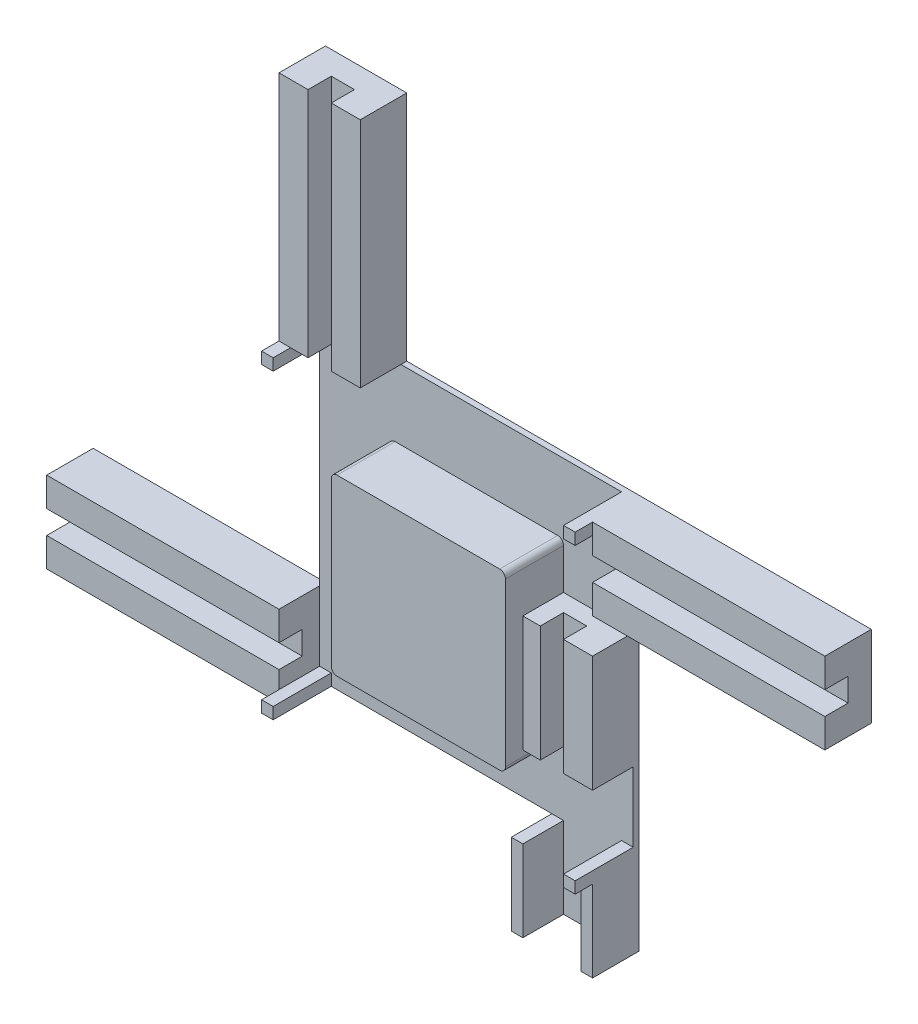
ISO-10303-21;
HEADER;
FILE_DESCRIPTION(('STEP AP214'),'2;1');
FILE_NAME('part.step','',(''),(''),'','','');
FILE_SCHEMA(('AUTOMOTIVE_DESIGN { 1 0 10303 214 1 1 1 1 }'));
ENDSEC;
DATA;
#1=APPLICATION_CONTEXT('core data for automotive mechanical design processes');
#2=APPLICATION_PROTOCOL_DEFINITION('international standard','automotive_design',2000,#1);
#3=PRODUCT_CONTEXT('',#1,'mechanical');
#4=PRODUCT('Part','Part','',(#3));
#5=PRODUCT_RELATED_PRODUCT_CATEGORY('part','',(#4));
#6=PRODUCT_DEFINITION_FORMATION('','',#4);
#7=PRODUCT_DEFINITION_CONTEXT('part definition',#1,'design');
#8=PRODUCT_DEFINITION('design','',#6,#7);
#9=PRODUCT_DEFINITION_SHAPE('','',#8);
#10=(LENGTH_UNIT() NAMED_UNIT(*) SI_UNIT(.MILLI.,.METRE.));
#11=(NAMED_UNIT(*) PLANE_ANGLE_UNIT() SI_UNIT($,.RADIAN.));
#12=(NAMED_UNIT(*) SI_UNIT($,.STERADIAN.) SOLID_ANGLE_UNIT());
#13=UNCERTAINTY_MEASURE_WITH_UNIT(LENGTH_MEASURE(1.E-05),#10,'distance_accuracy_value','');
#14=(GEOMETRIC_REPRESENTATION_CONTEXT(3) GLOBAL_UNCERTAINTY_ASSIGNED_CONTEXT((#13)) GLOBAL_UNIT_ASSIGNED_CONTEXT((#10,
#11,#12)) REPRESENTATION_CONTEXT('',''));
#15=CARTESIAN_POINT('',(0.,0.,0.));
#16=DIRECTION('',(0.,0.,1.));
#17=DIRECTION('',(1.,0.,0.));
#18=AXIS2_PLACEMENT_3D('',#15,#16,#17);
#19=CARTESIAN_POINT('',(75.,-275.141421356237,50.));
#20=DIRECTION('',(-1.,0.,0.));
#21=DIRECTION('',(0.,0.,1.));
#22=AXIS2_PLACEMENT_3D('',#19,#20,#21);
#23=PLANE('',#22);
#24=DIRECTION('',(0.,0.,1.));
#25=VECTOR('',#24,1.);
#26=CARTESIAN_POINT('',(75.,35.,50.));
#27=LINE('',#26,#25);
#28=CARTESIAN_POINT('',(75.,35.,0.));
#29=VERTEX_POINT('',#28);
#30=CARTESIAN_POINT('',(75.,35.,35.));
#31=VERTEX_POINT('',#30);
#32=EDGE_CURVE('E504',#29,#31,#27,.T.);
#33=ORIENTED_EDGE('',*,*,#32,.F.);
#34=DIRECTION('',(0.,1.,0.));
#35=VECTOR('',#34,1.);
#36=CARTESIAN_POINT('',(75.,-275.141421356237,0.));
#37=LINE('',#36,#35);
#38=CARTESIAN_POINT('',(75.,69.9999999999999,0.));
#39=VERTEX_POINT('',#38);
#40=EDGE_CURVE('E844',#29,#39,#37,.T.);
#41=ORIENTED_EDGE('',*,*,#40,.T.);
#42=DIRECTION('',(0.,0.,-1.));
#43=VECTOR('',#42,1.);
#44=CARTESIAN_POINT('',(75.,69.9999999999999,50.));
#45=LINE('',#44,#43);
#46=CARTESIAN_POINT('',(75.,69.9999999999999,50.));
#47=VERTEX_POINT('',#46);
#48=EDGE_CURVE('E858',#47,#39,#45,.T.);
#49=ORIENTED_EDGE('',*,*,#48,.F.);
#50=DIRECTION('',(0.,1.,0.));
#51=VECTOR('',#50,1.);
#52=CARTESIAN_POINT('',(75.,-275.141421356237,50.));
#53=LINE('',#52,#51);
#54=CARTESIAN_POINT('',(75.,-70.,50.));
#55=VERTEX_POINT('',#54);
#56=EDGE_CURVE('E827',#55,#47,#53,.T.);
#57=ORIENTED_EDGE('',*,*,#56,.F.);
#58=DIRECTION('',(0.,0.,-1.));
#59=VECTOR('',#58,1.);
#60=CARTESIAN_POINT('',(75.,-70.,50.));
#61=LINE('',#60,#59);
#62=CARTESIAN_POINT('',(75.,-70.,0.));
#63=VERTEX_POINT('',#62);
#64=EDGE_CURVE('E861',#55,#63,#61,.T.);
#65=ORIENTED_EDGE('',*,*,#64,.T.);
#66=CARTESIAN_POINT('',(75.,-65.,0.));
#67=VERTEX_POINT('',#66);
#68=EDGE_CURVE('E845',#63,#67,#37,.T.);
#69=ORIENTED_EDGE('',*,*,#68,.T.);
#70=DIRECTION('',(0.,0.,1.));
#71=VECTOR('',#70,1.);
#72=CARTESIAN_POINT('',(75.,-64.9999999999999,50.));
#73=LINE('',#72,#71);
#74=CARTESIAN_POINT('',(75.,-65.,35.));
#75=VERTEX_POINT('',#74);
#76=EDGE_CURVE('E62',#67,#75,#73,.T.);
#77=ORIENTED_EDGE('',*,*,#76,.T.);
#78=DIRECTION('',(0.,1.,0.));
#79=VECTOR('',#78,1.);
#80=CARTESIAN_POINT('',(75.,-275.141421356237,35.));
#81=LINE('',#80,#79);
#82=EDGE_CURVE('E11',#75,#31,#81,.T.);
#83=ORIENTED_EDGE('',*,*,#82,.T.);
#84=EDGE_LOOP('',(#33,#41,#49,#57,#65,#69,#77,#83));
#85=FACE_BOUND('',#84,.T.);
#86=ADVANCED_FACE('F36',(#85),#23,.F.);
#87=CARTESIAN_POINT('',(-125.,135.,0.));
#88=DIRECTION('',(0.,0.,-1.));
#89=DIRECTION('',(0.,1.,0.));
#90=AXIS2_PLACEMENT_3D('',#87,#88,#89);
#91=PLANE('',#90);
#92=DIRECTION('',(0.,1.,0.));
#93=VECTOR('',#92,1.);
#94=CARTESIAN_POINT('',(74.9999999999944,-335.000025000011,0.));
#95=LINE('',#94,#93);
#96=CARTESIAN_POINT('',(74.9999999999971,-205.000000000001,0.));
#97=VERTEX_POINT('',#96);
#98=CARTESIAN_POINT('',(74.9999999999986,-135.000000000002,0.));
#99=VERTEX_POINT('',#98);
#100=EDGE_CURVE('E453',#97,#99,#95,.T.);
#101=ORIENTED_EDGE('',*,*,#100,.F.);
#102=DIRECTION('',(-1.,0.,0.));
#103=VECTOR('',#102,1.);
#104=CARTESIAN_POINT('',(124.999999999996,-205.000000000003,0.));
#105=LINE('',#104,#103);
#106=CARTESIAN_POINT('',(124.999999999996,-205.000000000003,0.));
#107=VERTEX_POINT('',#106);
#108=EDGE_CURVE('E54',#107,#97,#105,.T.);
#109=ORIENTED_EDGE('',*,*,#108,.F.);
#110=DIRECTION('',(0.,1.,0.));
#111=VECTOR('',#110,1.);
#112=CARTESIAN_POINT('',(124.999999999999,-135.000000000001,0.));
#113=LINE('',#112,#111);
#114=CARTESIAN_POINT('',(124.999999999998,-125.000000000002,0.));
#115=VERTEX_POINT('',#114);
#116=EDGE_CURVE('E718',#107,#115,#113,.T.);
#117=ORIENTED_EDGE('',*,*,#116,.T.);
#118=DIRECTION('',(-1.,0.,0.));
#119=VECTOR('',#118,1.);
#120=CARTESIAN_POINT('',(134.999999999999,-125.000000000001,0.));
#121=LINE('',#120,#119);
#122=CARTESIAN_POINT('',(134.999999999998,-125.000000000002,0.));
#123=VERTEX_POINT('',#122);
#124=EDGE_CURVE('E755',#123,#115,#121,.T.);
#125=ORIENTED_EDGE('',*,*,#124,.F.);
#126=DIRECTION('',(0.,-1.,0.));
#127=VECTOR('',#126,1.);
#128=CARTESIAN_POINT('',(135.000000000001,124.999999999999,0.));
#129=LINE('',#128,#127);
#130=CARTESIAN_POINT('',(134.999999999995,-65.,0.));
#131=VERTEX_POINT('',#130);
#132=EDGE_CURVE('E752',#131,#123,#129,.T.);
#133=ORIENTED_EDGE('',*,*,#132,.F.);
#134=DIRECTION('',(-1.,0.,0.));
#135=VECTOR('',#134,1.);
#136=CARTESIAN_POINT('',(-125.,-65.,0.));
#137=LINE('',#136,#135);
#138=EDGE_CURVE('E1071',#131,#67,#137,.T.);
#139=ORIENTED_EDGE('',*,*,#138,.T.);
#140=ORIENTED_EDGE('',*,*,#68,.F.);
#141=CARTESIAN_POINT('',(70.,-70.,0.));
#142=DIRECTION('',(0.,0.,1.));
#143=DIRECTION('',(1.,0.,0.));
#144=AXIS2_PLACEMENT_3D('',#141,#142,#143);
#145=CIRCLE('',#144,4.99999999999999);
#146=CARTESIAN_POINT('',(70.,-74.9999999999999,0.));
#147=VERTEX_POINT('',#146);
#148=EDGE_CURVE('E842',#63,#147,#145,.F.);
#149=ORIENTED_EDGE('',*,*,#148,.T.);
#150=DIRECTION('',(-1.,0.,0.));
#151=VECTOR('',#150,1.);
#152=CARTESIAN_POINT('',(0.,-75.,0.));
#153=LINE('',#152,#151);
#154=CARTESIAN_POINT('',(-70.,-75.,0.));
#155=VERTEX_POINT('',#154);
#156=EDGE_CURVE('E840',#147,#155,#153,.T.);
#157=ORIENTED_EDGE('',*,*,#156,.T.);
#158=CARTESIAN_POINT('',(-70.,-70.,0.));
#159=DIRECTION('',(0.,0.,1.));
#160=DIRECTION('',(1.,0.,0.));
#161=AXIS2_PLACEMENT_3D('',#158,#159,#160);
#162=CIRCLE('',#161,4.99999999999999);
#163=CARTESIAN_POINT('',(-75.,-70.,0.));
#164=VERTEX_POINT('',#163);
#165=EDGE_CURVE('E838',#155,#164,#162,.F.);
#166=ORIENTED_EDGE('',*,*,#165,.T.);
#167=DIRECTION('',(0.,1.,0.));
#168=VECTOR('',#167,1.);
#169=CARTESIAN_POINT('',(-75.,-275.141421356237,0.));
#170=LINE('',#169,#168);
#171=CARTESIAN_POINT('',(-75.,69.9999999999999,0.));
#172=VERTEX_POINT('',#171);
#173=EDGE_CURVE('E836',#164,#172,#170,.T.);
#174=ORIENTED_EDGE('',*,*,#173,.T.);
#175=CARTESIAN_POINT('',(-70.,69.9999999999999,0.));
#176=DIRECTION('',(0.,0.,1.));
#177=DIRECTION('',(1.,0.,0.));
#178=AXIS2_PLACEMENT_3D('',#175,#176,#177);
#179=CIRCLE('',#178,4.99999999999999);
#180=CARTESIAN_POINT('',(-70.,74.9999999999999,0.));
#181=VERTEX_POINT('',#180);
#182=EDGE_CURVE('E800',#172,#181,#179,.F.);
#183=ORIENTED_EDGE('',*,*,#182,.T.);
#184=DIRECTION('',(-1.,0.,0.));
#185=VECTOR('',#184,1.);
#186=CARTESIAN_POINT('',(0.,74.9999999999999,0.));
#187=LINE('',#186,#185);
#188=CARTESIAN_POINT('',(70.,74.9999999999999,0.));
#189=VERTEX_POINT('',#188);
#190=EDGE_CURVE('E815',#189,#181,#187,.T.);
#191=ORIENTED_EDGE('',*,*,#190,.F.);
#192=CARTESIAN_POINT('',(70.,69.9999999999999,0.));
#193=DIRECTION('',(0.,0.,1.));
#194=DIRECTION('',(1.,0.,0.));
#195=AXIS2_PLACEMENT_3D('',#192,#193,#194);
#196=CIRCLE('',#195,4.99999999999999);
#197=EDGE_CURVE('E848',#189,#39,#196,.F.);
#198=ORIENTED_EDGE('',*,*,#197,.T.);
#199=ORIENTED_EDGE('',*,*,#40,.F.);
#200=DIRECTION('',(-1.,0.,0.));
#201=VECTOR('',#200,1.);
#202=CARTESIAN_POINT('',(-125.,35.,0.));
#203=LINE('',#202,#201);
#204=CARTESIAN_POINT('',(134.999999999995,35.,0.));
#205=VERTEX_POINT('',#204);
#206=EDGE_CURVE('E46',#205,#29,#203,.T.);
#207=ORIENTED_EDGE('',*,*,#206,.F.);
#208=CARTESIAN_POINT('',(135.000000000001,64.9999999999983,0.));
#209=VERTEX_POINT('',#208);
#210=EDGE_CURVE('E751',#209,#205,#129,.T.);
#211=ORIENTED_EDGE('',*,*,#210,.F.);
#212=CARTESIAN_POINT('',(135.000000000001,124.999999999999,0.));
#213=VERTEX_POINT('',#212);
#214=EDGE_CURVE('E746',#213,#209,#129,.T.);
#215=ORIENTED_EDGE('',*,*,#214,.F.);
#216=DIRECTION('',(-1.,0.,0.));
#217=VECTOR('',#216,1.);
#218=CARTESIAN_POINT('',(135.000000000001,124.999999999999,0.));
#219=LINE('',#218,#217);
#220=CARTESIAN_POINT('',(125.000000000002,124.999999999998,0.));
#221=VERTEX_POINT('',#220);
#222=EDGE_CURVE('E750',#213,#221,#219,.T.);
#223=ORIENTED_EDGE('',*,*,#222,.T.);
#224=DIRECTION('',(0.,-1.,0.));
#225=VECTOR('',#224,1.);
#226=CARTESIAN_POINT('',(125.,135.,0.));
#227=LINE('',#226,#225);
#228=CARTESIAN_POINT('',(125.000000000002,134.999999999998,0.));
#229=VERTEX_POINT('',#228);
#230=EDGE_CURVE('E740',#229,#221,#227,.T.);
#231=ORIENTED_EDGE('',*,*,#230,.F.);
#232=DIRECTION('',(1.,0.,0.));
#233=VECTOR('',#232,1.);
#234=CARTESIAN_POINT('',(-125.,135.,0.));
#235=LINE('',#234,#233);
#236=CARTESIAN_POINT('',(-64.9999999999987,135.000000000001,0.));
#237=VERTEX_POINT('',#236);
#238=EDGE_CURVE('E758',#237,#229,#235,.T.);
#239=ORIENTED_EDGE('',*,*,#238,.F.);
#240=CARTESIAN_POINT('',(-124.999999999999,135.000000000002,0.));
#241=VERTEX_POINT('',#240);
#242=EDGE_CURVE('E759',#241,#237,#235,.T.);
#243=ORIENTED_EDGE('',*,*,#242,.F.);
#244=DIRECTION('',(0.,-1.,0.));
#245=VECTOR('',#244,1.);
#246=CARTESIAN_POINT('',(-125.,135.,0.));
#247=LINE('',#246,#245);
#248=CARTESIAN_POINT('',(-124.999999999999,125.,0.));
#249=VERTEX_POINT('',#248);
#250=EDGE_CURVE('E762',#241,#249,#247,.T.);
#251=ORIENTED_EDGE('',*,*,#250,.T.);
#252=DIRECTION('',(1.,0.,0.));
#253=VECTOR('',#252,1.);
#254=CARTESIAN_POINT('',(-135.,125.,0.));
#255=LINE('',#254,#253);
#256=CARTESIAN_POINT('',(-135.,125.,0.));
#257=VERTEX_POINT('',#256);
#258=EDGE_CURVE('E706',#257,#249,#255,.T.);
#259=ORIENTED_EDGE('',*,*,#258,.F.);
#260=DIRECTION('',(0.,1.,0.));
#261=VECTOR('',#260,1.);
#262=CARTESIAN_POINT('',(-135.,-125.,0.));
#263=LINE('',#262,#261);
#264=CARTESIAN_POINT('',(-135.,-64.9999999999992,0.));
#265=VERTEX_POINT('',#264);
#266=EDGE_CURVE('E876',#265,#257,#263,.T.);
#267=ORIENTED_EDGE('',*,*,#266,.F.);
#268=CARTESIAN_POINT('',(-135.000000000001,-124.999999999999,0.));
#269=VERTEX_POINT('',#268);
#270=EDGE_CURVE('E886',#269,#265,#263,.T.);
#271=ORIENTED_EDGE('',*,*,#270,.F.);
#272=DIRECTION('',(1.,0.,0.));
#273=VECTOR('',#272,1.);
#274=CARTESIAN_POINT('',(-135.,-125.,0.));
#275=LINE('',#274,#273);
#276=CARTESIAN_POINT('',(-125.000000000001,-124.999999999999,0.));
#277=VERTEX_POINT('',#276);
#278=EDGE_CURVE('E882',#269,#277,#275,.T.);
#279=ORIENTED_EDGE('',*,*,#278,.T.);
#280=DIRECTION('',(0.,1.,0.));
#281=VECTOR('',#280,1.);
#282=CARTESIAN_POINT('',(-125.000000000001,-134.999999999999,0.));
#283=LINE('',#282,#281);
#284=CARTESIAN_POINT('',(-125.000000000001,-134.999999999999,0.));
#285=VERTEX_POINT('',#284);
#286=EDGE_CURVE('E742',#285,#277,#283,.T.);
#287=ORIENTED_EDGE('',*,*,#286,.F.);
#288=DIRECTION('',(-1.,0.,0.));
#289=VECTOR('',#288,1.);
#290=CARTESIAN_POINT('',(124.999999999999,-135.000000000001,0.));
#291=LINE('',#290,#289);
#292=CARTESIAN_POINT('',(64.9999999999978,-135.000000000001,0.));
#293=VERTEX_POINT('',#292);
#294=EDGE_CURVE('E665',#293,#285,#291,.T.);
#295=ORIENTED_EDGE('',*,*,#294,.F.);
#296=EDGE_CURVE('E719',#99,#293,#291,.T.);
#297=ORIENTED_EDGE('',*,*,#296,.F.);
#298=EDGE_LOOP('',(#101,#109,#117,#125,#133,#139,#140,#149,#157,#166,#174,#183,#191,#198,#199,
#207,#211,#215,#223,#231,#239,#243,#251,#259,#267,#271,#279,#287,#295,#297));
#299=FACE_BOUND('',#298,.T.);
#300=ADVANCED_FACE('F772',(#299),#91,.F.);
#301=CARTESIAN_POINT('',(-234.133109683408,135.000000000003,0.707352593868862));
#302=DIRECTION('',(0.,1.,0.));
#303=DIRECTION('',(-1.,0.,0.));
#304=AXIS2_PLACEMENT_3D('',#301,#302,#303);
#305=PLANE('',#304);
#306=DIRECTION('',(-1.,0.,0.));
#307=VECTOR('',#306,1.);
#308=CARTESIAN_POINT('',(-234.133109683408,135.000000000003,35.));
#309=LINE('',#308,#307);
#310=CARTESIAN_POINT('',(-109.999999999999,135.000000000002,35.));
#311=VERTEX_POINT('',#310);
#312=CARTESIAN_POINT('',(-124.999999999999,135.000000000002,35.));
#313=VERTEX_POINT('',#312);
#314=EDGE_CURVE('E1959',#311,#313,#309,.T.);
#315=ORIENTED_EDGE('',*,*,#314,.T.);
#316=DIRECTION('',(0.,0.,-1.));
#317=VECTOR('',#316,1.);
#318=CARTESIAN_POINT('',(-124.999999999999,135.000000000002,50.));
#319=LINE('',#318,#317);
#320=EDGE_CURVE('E1189',#313,#241,#319,.T.);
#321=ORIENTED_EDGE('',*,*,#320,.T.);
#322=ORIENTED_EDGE('',*,*,#242,.T.);
#323=DIRECTION('',(0.,0.,-1.));
#324=VECTOR('',#323,1.);
#325=CARTESIAN_POINT('',(-64.9999999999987,135.000000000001,0.707352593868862));
#326=LINE('',#325,#324);
#327=CARTESIAN_POINT('',(-64.9999999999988,135.000000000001,35.));
#328=VERTEX_POINT('',#327);
#329=EDGE_CURVE('E1981',#328,#237,#326,.T.);
#330=ORIENTED_EDGE('',*,*,#329,.F.);
#331=DIRECTION('',(1.,0.,0.));
#332=VECTOR('',#331,1.);
#333=CARTESIAN_POINT('',(-234.133109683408,135.000000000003,35.));
#334=LINE('',#333,#332);
#335=CARTESIAN_POINT('',(-89.9999999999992,135.000000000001,35.));
#336=VERTEX_POINT('',#335);
#337=EDGE_CURVE('E1982',#336,#328,#334,.T.);
#338=ORIENTED_EDGE('',*,*,#337,.F.);
#339=DIRECTION('',(0.,0.,-1.));
#340=VECTOR('',#339,1.);
#341=CARTESIAN_POINT('',(-89.9999999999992,135.000000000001,0.707352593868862));
#342=LINE('',#341,#340);
#343=CARTESIAN_POINT('',(-89.9999999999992,135.000000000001,15.));
#344=VERTEX_POINT('',#343);
#345=EDGE_CURVE('E2029',#336,#344,#342,.T.);
#346=ORIENTED_EDGE('',*,*,#345,.T.);
#347=DIRECTION('',(-1.,0.,0.));
#348=VECTOR('',#347,1.);
#349=CARTESIAN_POINT('',(-234.133109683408,135.000000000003,15.));
#350=LINE('',#349,#348);
#351=CARTESIAN_POINT('',(-109.999999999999,135.000000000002,15.));
#352=VERTEX_POINT('',#351);
#353=EDGE_CURVE('E1967',#344,#352,#350,.T.);
#354=ORIENTED_EDGE('',*,*,#353,.T.);
#355=DIRECTION('',(0.,0.,-1.));
#356=VECTOR('',#355,1.);
#357=CARTESIAN_POINT('',(-109.999999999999,135.000000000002,0.707352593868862));
#358=LINE('',#357,#356);
#359=EDGE_CURVE('E1965',#311,#352,#358,.T.);
#360=ORIENTED_EDGE('',*,*,#359,.F.);
#361=EDGE_LOOP('',(#315,#321,#322,#330,#338,#346,#354,#360));
#362=FACE_BOUND('',#361,.T.);
#363=ADVANCED_FACE('F977',(#362),#305,.F.);
#364=CARTESIAN_POINT('',(-234.133109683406,335.000000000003,-4.99999999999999));
#365=DIRECTION('',(0.,0.,1.));
#366=DIRECTION('',(-1.,0.,0.));
#367=AXIS2_PLACEMENT_3D('',#364,#365,#366);
#368=PLANE('',#367);
#369=DIRECTION('',(0.,1.,0.));
#370=VECTOR('',#369,1.);
#371=CARTESIAN_POINT('',(134.999999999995,-335.000000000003,-4.99999999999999));
#372=LINE('',#371,#370);
#373=CARTESIAN_POINT('',(134.999999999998,-205.000000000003,-4.99999999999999));
#374=VERTEX_POINT('',#373);
#375=CARTESIAN_POINT('',(135.000000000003,64.9999999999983,-4.99999999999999));
#376=VERTEX_POINT('',#375);
#377=EDGE_CURVE('E40',#374,#376,#372,.T.);
#378=ORIENTED_EDGE('',*,*,#377,.F.);
#379=DIRECTION('',(1.,0.,0.));
#380=VECTOR('',#379,1.);
#381=CARTESIAN_POINT('',(64.9999999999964,-205.000000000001,-5.));
#382=LINE('',#381,#380);
#383=CARTESIAN_POINT('',(64.9999999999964,-205.000000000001,-5.));
#384=VERTEX_POINT('',#383);
#385=EDGE_CURVE('E2037',#384,#374,#382,.T.);
#386=ORIENTED_EDGE('',*,*,#385,.F.);
#387=DIRECTION('',(0.,1.,0.));
#388=VECTOR('',#387,1.);
#389=CARTESIAN_POINT('',(64.9999999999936,-335.000000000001,-5.));
#390=LINE('',#389,#388);
#391=CARTESIAN_POINT('',(64.9999999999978,-135.000000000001,-5.));
#392=VERTEX_POINT('',#391);
#393=EDGE_CURVE('E732',#384,#392,#390,.T.);
#394=ORIENTED_EDGE('',*,*,#393,.T.);
#395=DIRECTION('',(1.,0.,0.));
#396=VECTOR('',#395,1.);
#397=CARTESIAN_POINT('',(-125.000000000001,-134.999999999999,-5.));
#398=LINE('',#397,#396);
#399=CARTESIAN_POINT('',(-335.000000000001,-134.999999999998,-4.99999999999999));
#400=VERTEX_POINT('',#399);
#401=EDGE_CURVE('E714',#400,#392,#398,.T.);
#402=ORIENTED_EDGE('',*,*,#401,.F.);
#403=DIRECTION('',(0.,-1.,0.));
#404=VECTOR('',#403,1.);
#405=CARTESIAN_POINT('',(-335.000000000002,-234.133109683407,-4.99999999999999));
#406=LINE('',#405,#404);
#407=CARTESIAN_POINT('',(-335.000000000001,-64.9999999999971,-5.));
#408=VERTEX_POINT('',#407);
#409=EDGE_CURVE('E697',#408,#400,#406,.T.);
#410=ORIENTED_EDGE('',*,*,#409,.F.);
#411=DIRECTION('',(1.,0.,0.));
#412=VECTOR('',#411,1.);
#413=CARTESIAN_POINT('',(-335.000000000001,-64.9999999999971,-5.));
#414=LINE('',#413,#412);
#415=CARTESIAN_POINT('',(-135.,-64.9999999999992,-5.));
#416=VERTEX_POINT('',#415);
#417=EDGE_CURVE('E673',#408,#416,#414,.T.);
#418=ORIENTED_EDGE('',*,*,#417,.T.);
#419=DIRECTION('',(0.,-1.,0.));
#420=VECTOR('',#419,1.);
#421=CARTESIAN_POINT('',(-134.999999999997,335.000000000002,-4.99999999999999));
#422=LINE('',#421,#420);
#423=CARTESIAN_POINT('',(-134.999999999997,335.000000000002,-4.99999999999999));
#424=VERTEX_POINT('',#423);
#425=EDGE_CURVE('E1184',#424,#416,#422,.T.);
#426=ORIENTED_EDGE('',*,*,#425,.F.);
#427=DIRECTION('',(-1.,0.,0.));
#428=VECTOR('',#427,1.);
#429=CARTESIAN_POINT('',(-234.133109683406,335.000000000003,-4.99999999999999));
#430=LINE('',#429,#428);
#431=CARTESIAN_POINT('',(-64.999999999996,335.000000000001,-5.));
#432=VERTEX_POINT('',#431);
#433=EDGE_CURVE('E792',#432,#424,#430,.T.);
#434=ORIENTED_EDGE('',*,*,#433,.F.);
#435=DIRECTION('',(0.,-1.,0.));
#436=VECTOR('',#435,1.);
#437=CARTESIAN_POINT('',(-64.999999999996,335.000000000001,-5.));
#438=LINE('',#437,#436);
#439=CARTESIAN_POINT('',(-64.9999999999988,135.000000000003,-4.99999999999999));
#440=VERTEX_POINT('',#439);
#441=EDGE_CURVE('E778',#432,#440,#438,.T.);
#442=ORIENTED_EDGE('',*,*,#441,.T.);
#443=DIRECTION('',(-1.,0.,0.));
#444=VECTOR('',#443,1.);
#445=CARTESIAN_POINT('',(335.000000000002,134.999999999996,-4.99999999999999));
#446=LINE('',#445,#444);
#447=CARTESIAN_POINT('',(335.000000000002,134.999999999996,-4.99999999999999));
#448=VERTEX_POINT('',#447);
#449=EDGE_CURVE('E568',#448,#440,#446,.T.);
#450=ORIENTED_EDGE('',*,*,#449,.F.);
#451=DIRECTION('',(0.,1.,0.));
#452=VECTOR('',#451,1.);
#453=CARTESIAN_POINT('',(335.000000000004,234.133109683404,-4.99999999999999));
#454=LINE('',#453,#452);
#455=CARTESIAN_POINT('',(335.000000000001,64.9999999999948,-5.));
#456=VERTEX_POINT('',#455);
#457=EDGE_CURVE('E530',#456,#448,#454,.T.);
#458=ORIENTED_EDGE('',*,*,#457,.F.);
#459=DIRECTION('',(-1.,0.,0.));
#460=VECTOR('',#459,1.);
#461=CARTESIAN_POINT('',(335.000000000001,64.9999999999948,-5.));
#462=LINE('',#461,#460);
#463=EDGE_CURVE('E562',#456,#376,#462,.T.);
#464=ORIENTED_EDGE('',*,*,#463,.T.);
#465=EDGE_LOOP('',(#378,#386,#394,#402,#410,#418,#426,#434,#442,#450,#458,#464));
#466=FACE_BOUND('',#465,.T.);
#467=ADVANCED_FACE('F38',(#466),#368,.F.);
#468=CARTESIAN_POINT('',(-134.999999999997,335.000000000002,0.707352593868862));
#469=DIRECTION('',(1.,0.,0.));
#470=DIRECTION('',(0.,1.,0.));
#471=AXIS2_PLACEMENT_3D('',#468,#469,#470);
#472=PLANE('',#471);
#473=ORIENTED_EDGE('',*,*,#425,.T.);
#474=DIRECTION('',(0.,0.,-1.));
#475=VECTOR('',#474,1.);
#476=CARTESIAN_POINT('',(-135.000000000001,-64.9999999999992,0.707352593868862));
#477=LINE('',#476,#475);
#478=EDGE_CURVE('E692',#265,#416,#477,.T.);
#479=ORIENTED_EDGE('',*,*,#478,.F.);
#480=ORIENTED_EDGE('',*,*,#266,.T.);
#481=DIRECTION('',(0.,0.,1.));
#482=VECTOR('',#481,1.);
#483=CARTESIAN_POINT('',(-134.999999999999,125.000000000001,-5.));
#484=LINE('',#483,#482);
#485=CARTESIAN_POINT('',(-134.999999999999,125.000000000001,50.));
#486=VERTEX_POINT('',#485);
#487=EDGE_CURVE('E806',#257,#486,#484,.T.);
#488=ORIENTED_EDGE('',*,*,#487,.T.);
#489=DIRECTION('',(0.,-1.,0.));
#490=VECTOR('',#489,1.);
#491=CARTESIAN_POINT('',(-134.999999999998,190.901699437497,50.));
#492=LINE('',#491,#490);
#493=CARTESIAN_POINT('',(-134.999999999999,135.000000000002,50.));
#494=VERTEX_POINT('',#493);
#495=EDGE_CURVE('E808',#494,#486,#492,.T.);
#496=ORIENTED_EDGE('',*,*,#495,.F.);
#497=DIRECTION('',(0.,0.,1.));
#498=VECTOR('',#497,1.);
#499=CARTESIAN_POINT('',(-134.999999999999,135.000000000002,-5.));
#500=LINE('',#499,#498);
#501=CARTESIAN_POINT('',(-134.999999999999,135.000000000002,35.));
#502=VERTEX_POINT('',#501);
#503=EDGE_CURVE('E787',#502,#494,#500,.T.);
#504=ORIENTED_EDGE('',*,*,#503,.F.);
#505=DIRECTION('',(0.,-1.,0.));
#506=VECTOR('',#505,1.);
#507=CARTESIAN_POINT('',(-134.999999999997,335.000000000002,35.));
#508=LINE('',#507,#506);
#509=CARTESIAN_POINT('',(-134.999999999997,335.000000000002,35.));
#510=VERTEX_POINT('',#509);
#511=EDGE_CURVE('E1190',#510,#502,#508,.T.);
#512=ORIENTED_EDGE('',*,*,#511,.F.);
#513=DIRECTION('',(0.,0.,1.));
#514=VECTOR('',#513,1.);
#515=CARTESIAN_POINT('',(-134.999999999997,335.000000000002,0.707352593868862));
#516=LINE('',#515,#514);
#517=EDGE_CURVE('E1186',#424,#510,#516,.T.);
#518=ORIENTED_EDGE('',*,*,#517,.F.);
#519=EDGE_LOOP('',(#473,#479,#480,#488,#496,#504,#512,#518));
#520=FACE_BOUND('',#519,.T.);
#521=ADVANCED_FACE('F1156',(#520),#472,.F.);
#522=CARTESIAN_POINT('',(-234.133109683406,335.000000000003,35.));
#523=DIRECTION('',(0.,0.,1.));
#524=DIRECTION('',(0.,-1.,0.));
#525=AXIS2_PLACEMENT_3D('',#522,#523,#524);
#526=PLANE('',#525);
#527=ORIENTED_EDGE('',*,*,#314,.F.);
#528=DIRECTION('',(0.,-1.,0.));
#529=VECTOR('',#528,1.);
#530=CARTESIAN_POINT('',(-109.999999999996,335.000000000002,35.));
#531=LINE('',#530,#529);
#532=CARTESIAN_POINT('',(-109.999999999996,335.000000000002,35.));
#533=VERTEX_POINT('',#532);
#534=EDGE_CURVE('E1194',#533,#311,#531,.T.);
#535=ORIENTED_EDGE('',*,*,#534,.F.);
#536=DIRECTION('',(-1.,0.,0.));
#537=VECTOR('',#536,1.);
#538=CARTESIAN_POINT('',(-234.133109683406,335.000000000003,35.));
#539=LINE('',#538,#537);
#540=EDGE_CURVE('E2001',#533,#510,#539,.T.);
#541=ORIENTED_EDGE('',*,*,#540,.T.);
#542=ORIENTED_EDGE('',*,*,#511,.T.);
#543=EDGE_CURVE('E780',#313,#502,#309,.T.);
#544=ORIENTED_EDGE('',*,*,#543,.F.);
#545=EDGE_LOOP('',(#527,#535,#541,#542,#544));
#546=FACE_BOUND('',#545,.T.);
#547=ADVANCED_FACE('F1175',(#546),#526,.T.);
#548=CARTESIAN_POINT('',(-109.999999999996,335.000000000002,0.707352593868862));
#549=DIRECTION('',(-1.,0.,0.));
#550=DIRECTION('',(0.,-1.,0.));
#551=AXIS2_PLACEMENT_3D('',#548,#549,#550);
#552=PLANE('',#551);
#553=ORIENTED_EDGE('',*,*,#359,.T.);
#554=DIRECTION('',(0.,-1.,0.));
#555=VECTOR('',#554,1.);
#556=CARTESIAN_POINT('',(-109.999999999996,335.000000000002,15.));
#557=LINE('',#556,#555);
#558=CARTESIAN_POINT('',(-109.999999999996,335.000000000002,15.));
#559=VERTEX_POINT('',#558);
#560=EDGE_CURVE('E1994',#559,#352,#557,.T.);
#561=ORIENTED_EDGE('',*,*,#560,.F.);
#562=DIRECTION('',(0.,0.,-1.));
#563=VECTOR('',#562,1.);
#564=CARTESIAN_POINT('',(-109.999999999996,335.000000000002,0.707352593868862));
#565=LINE('',#564,#563);
#566=EDGE_CURVE('E1999',#533,#559,#565,.T.);
#567=ORIENTED_EDGE('',*,*,#566,.F.);
#568=ORIENTED_EDGE('',*,*,#534,.T.);
#569=EDGE_LOOP('',(#553,#561,#567,#568));
#570=FACE_BOUND('',#569,.T.);
#571=ADVANCED_FACE('F1171',(#570),#552,.F.);
#572=CARTESIAN_POINT('',(-234.133109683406,335.000000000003,15.));
#573=DIRECTION('',(0.,0.,1.));
#574=DIRECTION('',(-1.,0.,0.));
#575=AXIS2_PLACEMENT_3D('',#572,#573,#574);
#576=PLANE('',#575);
#577=ORIENTED_EDGE('',*,*,#353,.F.);
#578=DIRECTION('',(0.,-1.,0.));
#579=VECTOR('',#578,1.);
#580=CARTESIAN_POINT('',(-89.9999999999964,335.000000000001,15.));
#581=LINE('',#580,#579);
#582=CARTESIAN_POINT('',(-89.9999999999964,335.000000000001,15.));
#583=VERTEX_POINT('',#582);
#584=EDGE_CURVE('E1993',#583,#344,#581,.T.);
#585=ORIENTED_EDGE('',*,*,#584,.F.);
#586=DIRECTION('',(-1.,0.,0.));
#587=VECTOR('',#586,1.);
#588=CARTESIAN_POINT('',(-234.133109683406,335.000000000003,15.));
#589=LINE('',#588,#587);
#590=EDGE_CURVE('E2003',#583,#559,#589,.T.);
#591=ORIENTED_EDGE('',*,*,#590,.T.);
#592=ORIENTED_EDGE('',*,*,#560,.T.);
#593=EDGE_LOOP('',(#577,#585,#591,#592));
#594=FACE_BOUND('',#593,.T.);
#595=ADVANCED_FACE('F1167',(#594),#576,.T.);
#596=CARTESIAN_POINT('',(-89.9999999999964,335.000000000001,0.707352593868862));
#597=DIRECTION('',(-1.,0.,0.));
#598=DIRECTION('',(0.,-1.,0.));
#599=AXIS2_PLACEMENT_3D('',#596,#597,#598);
#600=PLANE('',#599);
#601=ORIENTED_EDGE('',*,*,#345,.F.);
#602=DIRECTION('',(0.,-1.,0.));
#603=VECTOR('',#602,1.);
#604=CARTESIAN_POINT('',(-89.9999999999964,335.000000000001,35.));
#605=LINE('',#604,#603);
#606=CARTESIAN_POINT('',(-89.9999999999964,335.000000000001,35.));
#607=VERTEX_POINT('',#606);
#608=EDGE_CURVE('E1991',#607,#336,#605,.T.);
#609=ORIENTED_EDGE('',*,*,#608,.F.);
#610=DIRECTION('',(0.,0.,-1.));
#611=VECTOR('',#610,1.);
#612=CARTESIAN_POINT('',(-89.9999999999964,335.000000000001,0.707352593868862));
#613=LINE('',#612,#611);
#614=EDGE_CURVE('E2007',#607,#583,#613,.T.);
#615=ORIENTED_EDGE('',*,*,#614,.T.);
#616=ORIENTED_EDGE('',*,*,#584,.T.);
#617=EDGE_LOOP('',(#601,#609,#615,#616));
#618=FACE_BOUND('',#617,.T.);
#619=ADVANCED_FACE('F1163',(#618),#600,.T.);
#620=CARTESIAN_POINT('',(-234.133109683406,335.000000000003,35.));
#621=DIRECTION('',(0.,0.,-1.));
#622=DIRECTION('',(0.,1.,0.));
#623=AXIS2_PLACEMENT_3D('',#620,#621,#622);
#624=PLANE('',#623);
#625=ORIENTED_EDGE('',*,*,#337,.T.);
#626=DIRECTION('',(0.,-1.,0.));
#627=VECTOR('',#626,1.);
#628=CARTESIAN_POINT('',(-64.999999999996,335.000000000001,35.));
#629=LINE('',#628,#627);
#630=CARTESIAN_POINT('',(-64.999999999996,335.000000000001,35.));
#631=VERTEX_POINT('',#630);
#632=EDGE_CURVE('E1988',#631,#328,#629,.T.);
#633=ORIENTED_EDGE('',*,*,#632,.F.);
#634=DIRECTION('',(1.,0.,0.));
#635=VECTOR('',#634,1.);
#636=CARTESIAN_POINT('',(-234.133109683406,335.000000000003,35.));
#637=LINE('',#636,#635);
#638=EDGE_CURVE('E2009',#607,#631,#637,.T.);
#639=ORIENTED_EDGE('',*,*,#638,.F.);
#640=ORIENTED_EDGE('',*,*,#608,.T.);
#641=EDGE_LOOP('',(#625,#633,#639,#640));
#642=FACE_BOUND('',#641,.T.);
#643=ADVANCED_FACE('F1159',(#642),#624,.F.);
#644=CARTESIAN_POINT('',(-64.999999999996,335.000000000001,0.707352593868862));
#645=DIRECTION('',(-1.,0.,0.));
#646=DIRECTION('',(0.,-1.,0.));
#647=AXIS2_PLACEMENT_3D('',#644,#645,#646);
#648=PLANE('',#647);
#649=ORIENTED_EDGE('',*,*,#329,.T.);
#650=EDGE_CURVE('E1979',#237,#440,#326,.T.);
#651=ORIENTED_EDGE('',*,*,#650,.T.);
#652=ORIENTED_EDGE('',*,*,#441,.F.);
#653=DIRECTION('',(0.,0.,-1.));
#654=VECTOR('',#653,1.);
#655=CARTESIAN_POINT('',(-64.999999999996,335.000000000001,0.707352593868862));
#656=LINE('',#655,#654);
#657=EDGE_CURVE('E1971',#631,#432,#656,.T.);
#658=ORIENTED_EDGE('',*,*,#657,.F.);
#659=ORIENTED_EDGE('',*,*,#632,.T.);
#660=EDGE_LOOP('',(#649,#651,#652,#658,#659));
#661=FACE_BOUND('',#660,.T.);
#662=ADVANCED_FACE('F1151',(#661),#648,.F.);
#663=CARTESIAN_POINT('',(-234.133109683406,335.000000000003,0.707352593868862));
#664=DIRECTION('',(0.,1.,0.));
#665=DIRECTION('',(-1.,0.,0.));
#666=AXIS2_PLACEMENT_3D('',#663,#664,#665);
#667=PLANE('',#666);
#668=ORIENTED_EDGE('',*,*,#657,.T.);
#669=ORIENTED_EDGE('',*,*,#433,.T.);
#670=ORIENTED_EDGE('',*,*,#517,.T.);
#671=ORIENTED_EDGE('',*,*,#540,.F.);
#672=ORIENTED_EDGE('',*,*,#566,.T.);
#673=ORIENTED_EDGE('',*,*,#590,.F.);
#674=ORIENTED_EDGE('',*,*,#614,.F.);
#675=ORIENTED_EDGE('',*,*,#638,.T.);
#676=EDGE_LOOP('',(#668,#669,#670,#671,#672,#673,#674,#675));
#677=FACE_BOUND('',#676,.T.);
#678=ADVANCED_FACE('F1148',(#677),#667,.T.);
#679=CARTESIAN_POINT('',(335.000000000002,134.999999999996,0.707352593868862));
#680=DIRECTION('',(0.,-1.,0.));
#681=DIRECTION('',(1.,0.,0.));
#682=AXIS2_PLACEMENT_3D('',#679,#680,#681);
#683=PLANE('',#682);
#684=CARTESIAN_POINT('',(-124.999999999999,135.000000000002,50.));
#685=VERTEX_POINT('',#684);
#686=EDGE_CURVE('E791',#685,#313,#319,.T.);
#687=ORIENTED_EDGE('',*,*,#686,.T.);
#688=ORIENTED_EDGE('',*,*,#543,.T.);
#689=ORIENTED_EDGE('',*,*,#503,.T.);
#690=DIRECTION('',(1.,0.,0.));
#691=VECTOR('',#690,1.);
#692=CARTESIAN_POINT('',(-134.999999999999,135.000000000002,50.));
#693=LINE('',#692,#691);
#694=EDGE_CURVE('E790',#494,#685,#693,.T.);
#695=ORIENTED_EDGE('',*,*,#694,.T.);
#696=EDGE_LOOP('',(#687,#688,#689,#695));
#697=FACE_BOUND('',#696,.T.);
#698=ADVANCED_FACE('F1126',(#697),#683,.F.);
#699=CARTESIAN_POINT('',(135.000000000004,234.133109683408,0.707352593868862));
#700=DIRECTION('',(1.,0.,0.));
#701=DIRECTION('',(0.,1.,0.));
#702=AXIS2_PLACEMENT_3D('',#699,#700,#701);
#703=PLANE('',#702);
#704=DIRECTION('',(0.,1.,0.));
#705=VECTOR('',#704,1.);
#706=CARTESIAN_POINT('',(135.000000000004,234.133109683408,35.));
#707=LINE('',#706,#705);
#708=CARTESIAN_POINT('',(135.000000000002,109.999999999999,35.));
#709=VERTEX_POINT('',#708);
#710=CARTESIAN_POINT('',(135.000000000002,124.999999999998,35.));
#711=VERTEX_POINT('',#710);
#712=EDGE_CURVE('E552',#709,#711,#707,.T.);
#713=ORIENTED_EDGE('',*,*,#712,.T.);
#714=DIRECTION('',(0.,0.,-1.));
#715=VECTOR('',#714,1.);
#716=CARTESIAN_POINT('',(135.000000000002,124.999999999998,50.));
#717=LINE('',#716,#715);
#718=EDGE_CURVE('E777',#711,#213,#717,.T.);
#719=ORIENTED_EDGE('',*,*,#718,.T.);
#720=ORIENTED_EDGE('',*,*,#214,.T.);
#721=DIRECTION('',(0.,0.,-1.));
#722=VECTOR('',#721,1.);
#723=CARTESIAN_POINT('',(135.000000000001,64.9999999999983,0.707352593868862));
#724=LINE('',#723,#722);
#725=CARTESIAN_POINT('',(135.000000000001,64.9999999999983,35.));
#726=VERTEX_POINT('',#725);
#727=EDGE_CURVE('E534',#726,#209,#724,.T.);
#728=ORIENTED_EDGE('',*,*,#727,.F.);
#729=DIRECTION('',(0.,-1.,0.));
#730=VECTOR('',#729,1.);
#731=CARTESIAN_POINT('',(135.000000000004,234.133109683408,35.));
#732=LINE('',#731,#730);
#733=CARTESIAN_POINT('',(135.000000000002,89.9999999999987,35.));
#734=VERTEX_POINT('',#733);
#735=EDGE_CURVE('E576',#734,#726,#732,.T.);
#736=ORIENTED_EDGE('',*,*,#735,.F.);
#737=DIRECTION('',(0.,0.,-1.));
#738=VECTOR('',#737,1.);
#739=CARTESIAN_POINT('',(135.000000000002,89.9999999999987,0.707352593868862));
#740=LINE('',#739,#738);
#741=CARTESIAN_POINT('',(135.000000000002,89.9999999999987,15.));
#742=VERTEX_POINT('',#741);
#743=EDGE_CURVE('E2063',#734,#742,#740,.T.);
#744=ORIENTED_EDGE('',*,*,#743,.T.);
#745=DIRECTION('',(0.,1.,0.));
#746=VECTOR('',#745,1.);
#747=CARTESIAN_POINT('',(135.000000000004,234.133109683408,15.));
#748=LINE('',#747,#746);
#749=CARTESIAN_POINT('',(135.000000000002,109.999999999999,15.));
#750=VERTEX_POINT('',#749);
#751=EDGE_CURVE('E605',#742,#750,#748,.T.);
#752=ORIENTED_EDGE('',*,*,#751,.T.);
#753=DIRECTION('',(0.,0.,-1.));
#754=VECTOR('',#753,1.);
#755=CARTESIAN_POINT('',(135.000000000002,109.999999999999,0.707352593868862));
#756=LINE('',#755,#754);
#757=EDGE_CURVE('E556',#709,#750,#756,.T.);
#758=ORIENTED_EDGE('',*,*,#757,.F.);
#759=EDGE_LOOP('',(#713,#719,#720,#728,#736,#744,#752,#758));
#760=FACE_BOUND('',#759,.T.);
#761=ADVANCED_FACE('F601',(#760),#703,.F.);
#762=ORIENTED_EDGE('',*,*,#650,.F.);
#763=ORIENTED_EDGE('',*,*,#238,.T.);
#764=DIRECTION('',(0.,0.,1.));
#765=VECTOR('',#764,1.);
#766=CARTESIAN_POINT('',(125.000000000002,134.999999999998,-5.));
#767=LINE('',#766,#765);
#768=CARTESIAN_POINT('',(125.000000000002,134.999999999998,50.));
#769=VERTEX_POINT('',#768);
#770=EDGE_CURVE('E506',#229,#769,#767,.T.);
#771=ORIENTED_EDGE('',*,*,#770,.T.);
#772=DIRECTION('',(-1.,0.,0.));
#773=VECTOR('',#772,1.);
#774=CARTESIAN_POINT('',(190.901699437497,134.999999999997,50.));
#775=LINE('',#774,#773);
#776=CARTESIAN_POINT('',(135.000000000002,134.999999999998,50.));
#777=VERTEX_POINT('',#776);
#778=EDGE_CURVE('E515',#777,#769,#775,.T.);
#779=ORIENTED_EDGE('',*,*,#778,.F.);
#780=DIRECTION('',(0.,0.,1.));
#781=VECTOR('',#780,1.);
#782=CARTESIAN_POINT('',(135.000000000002,134.999999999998,-5.));
#783=LINE('',#782,#781);
#784=CARTESIAN_POINT('',(135.000000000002,134.999999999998,35.));
#785=VERTEX_POINT('',#784);
#786=EDGE_CURVE('E521',#785,#777,#783,.T.);
#787=ORIENTED_EDGE('',*,*,#786,.F.);
#788=DIRECTION('',(-1.,0.,0.));
#789=VECTOR('',#788,1.);
#790=CARTESIAN_POINT('',(335.000000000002,134.999999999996,35.));
#791=LINE('',#790,#789);
#792=CARTESIAN_POINT('',(335.000000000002,134.999999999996,35.));
#793=VERTEX_POINT('',#792);
#794=EDGE_CURVE('E565',#793,#785,#791,.T.);
#795=ORIENTED_EDGE('',*,*,#794,.F.);
#796=DIRECTION('',(0.,0.,1.));
#797=VECTOR('',#796,1.);
#798=CARTESIAN_POINT('',(335.000000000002,134.999999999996,0.707352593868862));
#799=LINE('',#798,#797);
#800=EDGE_CURVE('E533',#448,#793,#799,.T.);
#801=ORIENTED_EDGE('',*,*,#800,.F.);
#802=ORIENTED_EDGE('',*,*,#449,.T.);
#803=EDGE_LOOP('',(#762,#763,#771,#779,#787,#795,#801,#802));
#804=FACE_BOUND('',#803,.T.);
#805=ADVANCED_FACE('F618',(#804),#683,.F.);
#806=CARTESIAN_POINT('',(335.000000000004,234.133109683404,35.));
#807=DIRECTION('',(0.,0.,1.));
#808=DIRECTION('',(-1.,0.,0.));
#809=AXIS2_PLACEMENT_3D('',#806,#807,#808);
#810=PLANE('',#809);
#811=ORIENTED_EDGE('',*,*,#712,.F.);
#812=DIRECTION('',(-1.,0.,0.));
#813=VECTOR('',#812,1.);
#814=CARTESIAN_POINT('',(335.000000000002,109.999999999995,35.));
#815=LINE('',#814,#813);
#816=CARTESIAN_POINT('',(335.000000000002,109.999999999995,35.));
#817=VERTEX_POINT('',#816);
#818=EDGE_CURVE('E569',#817,#709,#815,.T.);
#819=ORIENTED_EDGE('',*,*,#818,.F.);
#820=DIRECTION('',(0.,1.,0.));
#821=VECTOR('',#820,1.);
#822=CARTESIAN_POINT('',(335.000000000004,234.133109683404,35.));
#823=LINE('',#822,#821);
#824=EDGE_CURVE('E536',#817,#793,#823,.T.);
#825=ORIENTED_EDGE('',*,*,#824,.T.);
#826=ORIENTED_EDGE('',*,*,#794,.T.);
#827=EDGE_CURVE('E557',#711,#785,#707,.T.);
#828=ORIENTED_EDGE('',*,*,#827,.F.);
#829=EDGE_LOOP('',(#811,#819,#825,#826,#828));
#830=FACE_BOUND('',#829,.T.);
#831=ADVANCED_FACE('F607',(#830),#810,.T.);
#832=CARTESIAN_POINT('',(335.000000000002,109.999999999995,0.707352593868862));
#833=DIRECTION('',(0.,1.,0.));
#834=DIRECTION('',(-1.,0.,0.));
#835=AXIS2_PLACEMENT_3D('',#832,#833,#834);
#836=PLANE('',#835);
#837=ORIENTED_EDGE('',*,*,#757,.T.);
#838=DIRECTION('',(-1.,0.,0.));
#839=VECTOR('',#838,1.);
#840=CARTESIAN_POINT('',(335.000000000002,109.999999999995,15.));
#841=LINE('',#840,#839);
#842=CARTESIAN_POINT('',(335.000000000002,109.999999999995,15.));
#843=VERTEX_POINT('',#842);
#844=EDGE_CURVE('E589',#843,#750,#841,.T.);
#845=ORIENTED_EDGE('',*,*,#844,.F.);
#846=DIRECTION('',(0.,0.,-1.));
#847=VECTOR('',#846,1.);
#848=CARTESIAN_POINT('',(335.000000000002,109.999999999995,0.707352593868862));
#849=LINE('',#848,#847);
#850=EDGE_CURVE('E539',#817,#843,#849,.T.);
#851=ORIENTED_EDGE('',*,*,#850,.F.);
#852=ORIENTED_EDGE('',*,*,#818,.T.);
#853=EDGE_LOOP('',(#837,#845,#851,#852));
#854=FACE_BOUND('',#853,.T.);
#855=ADVANCED_FACE('F594',(#854),#836,.F.);
#856=CARTESIAN_POINT('',(335.000000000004,234.133109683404,15.));
#857=DIRECTION('',(0.,0.,1.));
#858=DIRECTION('',(0.,1.,0.));
#859=AXIS2_PLACEMENT_3D('',#856,#857,#858);
#860=PLANE('',#859);
#861=ORIENTED_EDGE('',*,*,#751,.F.);
#862=DIRECTION('',(-1.,0.,0.));
#863=VECTOR('',#862,1.);
#864=CARTESIAN_POINT('',(335.000000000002,89.9999999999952,15.));
#865=LINE('',#864,#863);
#866=CARTESIAN_POINT('',(335.000000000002,89.9999999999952,15.));
#867=VERTEX_POINT('',#866);
#868=EDGE_CURVE('E587',#867,#742,#865,.T.);
#869=ORIENTED_EDGE('',*,*,#868,.F.);
#870=DIRECTION('',(0.,1.,0.));
#871=VECTOR('',#870,1.);
#872=CARTESIAN_POINT('',(335.000000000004,234.133109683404,15.));
#873=LINE('',#872,#871);
#874=EDGE_CURVE('E541',#867,#843,#873,.T.);
#875=ORIENTED_EDGE('',*,*,#874,.T.);
#876=ORIENTED_EDGE('',*,*,#844,.T.);
#877=EDGE_LOOP('',(#861,#869,#875,#876));
#878=FACE_BOUND('',#877,.T.);
#879=ADVANCED_FACE('F1137',(#878),#860,.T.);
#880=CARTESIAN_POINT('',(335.000000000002,89.9999999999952,0.707352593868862));
#881=DIRECTION('',(0.,1.,0.));
#882=DIRECTION('',(-1.,0.,0.));
#883=AXIS2_PLACEMENT_3D('',#880,#881,#882);
#884=PLANE('',#883);
#885=ORIENTED_EDGE('',*,*,#743,.F.);
#886=DIRECTION('',(-1.,0.,0.));
#887=VECTOR('',#886,1.);
#888=CARTESIAN_POINT('',(335.000000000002,89.9999999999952,35.));
#889=LINE('',#888,#887);
#890=CARTESIAN_POINT('',(335.000000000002,89.9999999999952,35.));
#891=VERTEX_POINT('',#890);
#892=EDGE_CURVE('E585',#891,#734,#889,.T.);
#893=ORIENTED_EDGE('',*,*,#892,.F.);
#894=DIRECTION('',(0.,0.,-1.));
#895=VECTOR('',#894,1.);
#896=CARTESIAN_POINT('',(335.000000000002,89.9999999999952,0.707352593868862));
#897=LINE('',#896,#895);
#898=EDGE_CURVE('E544',#891,#867,#897,.T.);
#899=ORIENTED_EDGE('',*,*,#898,.T.);
#900=ORIENTED_EDGE('',*,*,#868,.T.);
#901=EDGE_LOOP('',(#885,#893,#899,#900));
#902=FACE_BOUND('',#901,.T.);
#903=ADVANCED_FACE('F1133',(#902),#884,.T.);
#904=CARTESIAN_POINT('',(335.000000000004,234.133109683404,35.));
#905=DIRECTION('',(0.,0.,-1.));
#906=DIRECTION('',(1.,0.,0.));
#907=AXIS2_PLACEMENT_3D('',#904,#905,#906);
#908=PLANE('',#907);
#909=ORIENTED_EDGE('',*,*,#735,.T.);
#910=DIRECTION('',(-1.,0.,0.));
#911=VECTOR('',#910,1.);
#912=CARTESIAN_POINT('',(335.000000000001,64.9999999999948,35.));
#913=LINE('',#912,#911);
#914=CARTESIAN_POINT('',(335.000000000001,64.9999999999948,35.));
#915=VERTEX_POINT('',#914);
#916=EDGE_CURVE('E551',#915,#726,#913,.T.);
#917=ORIENTED_EDGE('',*,*,#916,.F.);
#918=DIRECTION('',(0.,-1.,0.));
#919=VECTOR('',#918,1.);
#920=CARTESIAN_POINT('',(335.000000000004,234.133109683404,35.));
#921=LINE('',#920,#919);
#922=EDGE_CURVE('E547',#891,#915,#921,.T.);
#923=ORIENTED_EDGE('',*,*,#922,.F.);
#924=ORIENTED_EDGE('',*,*,#892,.T.);
#925=EDGE_LOOP('',(#909,#917,#923,#924));
#926=FACE_BOUND('',#925,.T.);
#927=ADVANCED_FACE('F1129',(#926),#908,.F.);
#928=CARTESIAN_POINT('',(335.000000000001,64.9999999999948,0.707352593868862));
#929=DIRECTION('',(0.,1.,0.));
#930=DIRECTION('',(-1.,0.,0.));
#931=AXIS2_PLACEMENT_3D('',#928,#929,#930);
#932=PLANE('',#931);
#933=ORIENTED_EDGE('',*,*,#727,.T.);
#934=EDGE_CURVE('E572',#209,#376,#724,.T.);
#935=ORIENTED_EDGE('',*,*,#934,.T.);
#936=ORIENTED_EDGE('',*,*,#463,.F.);
#937=DIRECTION('',(0.,0.,-1.));
#938=VECTOR('',#937,1.);
#939=CARTESIAN_POINT('',(335.000000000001,64.9999999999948,0.707352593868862));
#940=LINE('',#939,#938);
#941=EDGE_CURVE('E549',#915,#456,#940,.T.);
#942=ORIENTED_EDGE('',*,*,#941,.F.);
#943=ORIENTED_EDGE('',*,*,#916,.T.);
#944=EDGE_LOOP('',(#933,#935,#936,#942,#943));
#945=FACE_BOUND('',#944,.T.);
#946=ADVANCED_FACE('F1122',(#945),#932,.F.);
#947=CARTESIAN_POINT('',(335.000000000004,234.133109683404,0.707352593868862));
#948=DIRECTION('',(1.,0.,0.));
#949=DIRECTION('',(0.,1.,0.));
#950=AXIS2_PLACEMENT_3D('',#947,#948,#949);
#951=PLANE('',#950);
#952=ORIENTED_EDGE('',*,*,#941,.T.);
#953=ORIENTED_EDGE('',*,*,#457,.T.);
#954=ORIENTED_EDGE('',*,*,#800,.T.);
#955=ORIENTED_EDGE('',*,*,#824,.F.);
#956=ORIENTED_EDGE('',*,*,#850,.T.);
#957=ORIENTED_EDGE('',*,*,#874,.F.);
#958=ORIENTED_EDGE('',*,*,#898,.F.);
#959=ORIENTED_EDGE('',*,*,#922,.T.);
#960=EDGE_LOOP('',(#952,#953,#954,#955,#956,#957,#958,#959));
#961=FACE_BOUND('',#960,.T.);
#962=ADVANCED_FACE('F1110',(#961),#951,.T.);
#963=CARTESIAN_POINT('',(134.999999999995,-335.000000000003,0.707352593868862));
#964=DIRECTION('',(-1.,0.,0.));
#965=DIRECTION('',(0.,-1.,0.));
#966=AXIS2_PLACEMENT_3D('',#963,#964,#965);
#967=PLANE('',#966);
#968=CARTESIAN_POINT('',(135.000000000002,124.999999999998,50.));
#969=VERTEX_POINT('',#968);
#970=EDGE_CURVE('E510',#969,#711,#717,.T.);
#971=ORIENTED_EDGE('',*,*,#970,.T.);
#972=ORIENTED_EDGE('',*,*,#827,.T.);
#973=ORIENTED_EDGE('',*,*,#786,.T.);
#974=DIRECTION('',(0.,-1.,0.));
#975=VECTOR('',#974,1.);
#976=CARTESIAN_POINT('',(135.000000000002,134.999999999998,50.));
#977=LINE('',#976,#975);
#978=EDGE_CURVE('E517',#777,#969,#977,.T.);
#979=ORIENTED_EDGE('',*,*,#978,.T.);
#980=EDGE_LOOP('',(#971,#972,#973,#979));
#981=FACE_BOUND('',#980,.T.);
#982=ADVANCED_FACE('F612',(#981),#967,.F.);
#983=CARTESIAN_POINT('',(234.133109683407,-135.000000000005,0.707352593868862));
#984=DIRECTION('',(0.,-1.,0.));
#985=DIRECTION('',(1.,0.,0.));
#986=AXIS2_PLACEMENT_3D('',#983,#984,#985);
#987=PLANE('',#986);
#988=DIRECTION('',(-1.,0.,0.));
#989=VECTOR('',#988,1.);
#990=CARTESIAN_POINT('',(234.133109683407,-135.000000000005,35.));
#991=LINE('',#990,#989);
#992=CARTESIAN_POINT('',(74.9999999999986,-135.000000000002,35.));
#993=VERTEX_POINT('',#992);
#994=CARTESIAN_POINT('',(64.9999999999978,-135.000000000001,35.));
#995=VERTEX_POINT('',#994);
#996=EDGE_CURVE('E726',#993,#995,#991,.T.);
#997=ORIENTED_EDGE('',*,*,#996,.F.);
#998=DIRECTION('',(0.,0.,1.));
#999=VECTOR('',#998,1.);
#1000=CARTESIAN_POINT('',(74.9999999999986,-135.000000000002,35.));
#1001=LINE('',#1000,#999);
#1002=EDGE_CURVE('E449',#99,#993,#1001,.T.);
#1003=ORIENTED_EDGE('',*,*,#1002,.F.);
#1004=ORIENTED_EDGE('',*,*,#296,.T.);
#1005=DIRECTION('',(0.,0.,-1.));
#1006=VECTOR('',#1005,1.);
#1007=CARTESIAN_POINT('',(64.9999999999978,-135.000000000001,0.707352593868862));
#1008=LINE('',#1007,#1006);
#1009=EDGE_CURVE('E1097',#995,#293,#1008,.T.);
#1010=ORIENTED_EDGE('',*,*,#1009,.F.);
#1011=EDGE_LOOP('',(#997,#1003,#1004,#1010));
#1012=FACE_BOUND('',#1011,.T.);
#1013=ADVANCED_FACE('F1101',(#1012),#987,.F.);
#1014=DIRECTION('',(0.,1.,0.));
#1015=VECTOR('',#1014,1.);
#1016=CARTESIAN_POINT('',(134.999999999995,-335.000000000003,35.));
#1017=LINE('',#1016,#1015);
#1018=CARTESIAN_POINT('',(134.999999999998,-205.000000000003,35.));
#1019=VERTEX_POINT('',#1018);
#1020=CARTESIAN_POINT('',(134.999999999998,-135.000000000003,35.));
#1021=VERTEX_POINT('',#1020);
#1022=EDGE_CURVE('E737',#1019,#1021,#1017,.T.);
#1023=ORIENTED_EDGE('',*,*,#1022,.F.);
#1024=DIRECTION('',(0.,0.,1.));
#1025=VECTOR('',#1024,1.);
#1026=CARTESIAN_POINT('',(134.999999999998,-205.000000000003,-4.99999999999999));
#1027=LINE('',#1026,#1025);
#1028=EDGE_CURVE('E2036',#374,#1019,#1027,.T.);
#1029=ORIENTED_EDGE('',*,*,#1028,.F.);
#1030=ORIENTED_EDGE('',*,*,#377,.T.);
#1031=ORIENTED_EDGE('',*,*,#934,.F.);
#1032=ORIENTED_EDGE('',*,*,#210,.T.);
#1033=DIRECTION('',(0.,0.,1.));
#1034=VECTOR('',#1033,1.);
#1035=CARTESIAN_POINT('',(134.999999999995,35.,-4.99999999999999));
#1036=LINE('',#1035,#1034);
#1037=CARTESIAN_POINT('',(134.999999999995,35.,35.));
#1038=VERTEX_POINT('',#1037);
#1039=EDGE_CURVE('E462',#205,#1038,#1036,.T.);
#1040=ORIENTED_EDGE('',*,*,#1039,.T.);
#1041=DIRECTION('',(0.,-1.,0.));
#1042=VECTOR('',#1041,1.);
#1043=CARTESIAN_POINT('',(134.999999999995,35.,35.));
#1044=LINE('',#1043,#1042);
#1045=CARTESIAN_POINT('',(134.999999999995,-65.,35.));
#1046=VERTEX_POINT('',#1045);
#1047=EDGE_CURVE('E477',#1038,#1046,#1044,.T.);
#1048=ORIENTED_EDGE('',*,*,#1047,.T.);
#1049=DIRECTION('',(0.,0.,1.));
#1050=VECTOR('',#1049,1.);
#1051=CARTESIAN_POINT('',(134.999999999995,-65.,-4.99999999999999));
#1052=LINE('',#1051,#1050);
#1053=EDGE_CURVE('E480',#131,#1046,#1052,.T.);
#1054=ORIENTED_EDGE('',*,*,#1053,.F.);
#1055=ORIENTED_EDGE('',*,*,#132,.T.);
#1056=DIRECTION('',(0.,0.,1.));
#1057=VECTOR('',#1056,1.);
#1058=CARTESIAN_POINT('',(134.999999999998,-125.000000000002,-5.));
#1059=LINE('',#1058,#1057);
#1060=CARTESIAN_POINT('',(134.999999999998,-125.000000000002,50.));
#1061=VERTEX_POINT('',#1060);
#1062=EDGE_CURVE('E520',#123,#1061,#1059,.T.);
#1063=ORIENTED_EDGE('',*,*,#1062,.T.);
#1064=DIRECTION('',(0.,1.,0.));
#1065=VECTOR('',#1064,1.);
#1066=CARTESIAN_POINT('',(134.999999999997,-190.901699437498,50.));
#1067=LINE('',#1066,#1065);
#1068=CARTESIAN_POINT('',(134.999999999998,-135.000000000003,50.));
#1069=VERTEX_POINT('',#1068);
#1070=EDGE_CURVE('E629',#1069,#1061,#1067,.T.);
#1071=ORIENTED_EDGE('',*,*,#1070,.F.);
#1072=DIRECTION('',(0.,0.,1.));
#1073=VECTOR('',#1072,1.);
#1074=CARTESIAN_POINT('',(134.999999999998,-135.000000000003,-5.));
#1075=LINE('',#1074,#1073);
#1076=EDGE_CURVE('E641',#1021,#1069,#1075,.T.);
#1077=ORIENTED_EDGE('',*,*,#1076,.F.);
#1078=EDGE_LOOP('',(#1023,#1029,#1030,#1031,#1032,#1040,#1048,#1054,#1055,#1063,#1071,#1077));
#1079=FACE_BOUND('',#1078,.T.);
#1080=ADVANCED_FACE('F1074',(#1079),#967,.F.);
#1081=CARTESIAN_POINT('',(234.133109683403,-335.000000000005,35.));
#1082=DIRECTION('',(0.,0.,1.));
#1083=DIRECTION('',(0.,1.,0.));
#1084=AXIS2_PLACEMENT_3D('',#1081,#1082,#1083);
#1085=PLANE('',#1084);
#1086=DIRECTION('',(-1.,0.,0.));
#1087=VECTOR('',#1086,1.);
#1088=CARTESIAN_POINT('',(134.999999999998,-205.000000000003,35.));
#1089=LINE('',#1088,#1087);
#1090=CARTESIAN_POINT('',(124.999999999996,-205.000000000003,35.));
#1091=VERTEX_POINT('',#1090);
#1092=EDGE_CURVE('E2042',#1019,#1091,#1089,.T.);
#1093=ORIENTED_EDGE('',*,*,#1092,.F.);
#1094=ORIENTED_EDGE('',*,*,#1022,.T.);
#1095=DIRECTION('',(1.,0.,0.));
#1096=VECTOR('',#1095,1.);
#1097=CARTESIAN_POINT('',(234.133109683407,-135.000000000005,35.));
#1098=LINE('',#1097,#1096);
#1099=CARTESIAN_POINT('',(124.999999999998,-135.000000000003,35.));
#1100=VERTEX_POINT('',#1099);
#1101=EDGE_CURVE('E729',#1100,#1021,#1098,.T.);
#1102=ORIENTED_EDGE('',*,*,#1101,.F.);
#1103=DIRECTION('',(0.,1.,0.));
#1104=VECTOR('',#1103,1.);
#1105=CARTESIAN_POINT('',(124.999999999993,-335.000025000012,35.));
#1106=LINE('',#1105,#1104);
#1107=EDGE_CURVE('E451',#1091,#1100,#1106,.T.);
#1108=ORIENTED_EDGE('',*,*,#1107,.F.);
#1109=EDGE_LOOP('',(#1093,#1094,#1102,#1108));
#1110=FACE_BOUND('',#1109,.T.);
#1111=ADVANCED_FACE('F1108',(#1110),#1085,.T.);
#1112=CARTESIAN_POINT('',(234.133109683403,-335.000000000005,35.));
#1113=DIRECTION('',(0.,0.,-1.));
#1114=DIRECTION('',(0.,-1.,0.));
#1115=AXIS2_PLACEMENT_3D('',#1112,#1113,#1114);
#1116=PLANE('',#1115);
#1117=DIRECTION('',(0.,1.,0.));
#1118=VECTOR('',#1117,1.);
#1119=CARTESIAN_POINT('',(64.9999999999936,-335.000000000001,35.));
#1120=LINE('',#1119,#1118);
#1121=CARTESIAN_POINT('',(64.9999999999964,-205.000000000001,35.));
#1122=VERTEX_POINT('',#1121);
#1123=EDGE_CURVE('E444',#1122,#995,#1120,.T.);
#1124=ORIENTED_EDGE('',*,*,#1123,.F.);
#1125=DIRECTION('',(-1.,0.,0.));
#1126=VECTOR('',#1125,1.);
#1127=CARTESIAN_POINT('',(74.9999999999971,-205.000000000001,35.));
#1128=LINE('',#1127,#1126);
#1129=CARTESIAN_POINT('',(74.9999999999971,-205.000000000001,35.));
#1130=VERTEX_POINT('',#1129);
#1131=EDGE_CURVE('E432',#1130,#1122,#1128,.T.);
#1132=ORIENTED_EDGE('',*,*,#1131,.F.);
#1133=DIRECTION('',(0.,1.,0.));
#1134=VECTOR('',#1133,1.);
#1135=CARTESIAN_POINT('',(74.9999999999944,-335.000025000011,35.));
#1136=LINE('',#1135,#1134);
#1137=EDGE_CURVE('E442',#1130,#993,#1136,.T.);
#1138=ORIENTED_EDGE('',*,*,#1137,.T.);
#1139=ORIENTED_EDGE('',*,*,#996,.T.);
#1140=EDGE_LOOP('',(#1124,#1132,#1138,#1139));
#1141=FACE_BOUND('',#1140,.T.);
#1142=ADVANCED_FACE('F440',(#1141),#1116,.F.);
#1143=CARTESIAN_POINT('',(64.9999999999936,-335.000000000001,0.707352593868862));
#1144=DIRECTION('',(1.,0.,0.));
#1145=DIRECTION('',(0.,1.,0.));
#1146=AXIS2_PLACEMENT_3D('',#1143,#1144,#1145);
#1147=PLANE('',#1146);
#1148=ORIENTED_EDGE('',*,*,#393,.F.);
#1149=DIRECTION('',(0.,0.,-1.));
#1150=VECTOR('',#1149,1.);
#1151=CARTESIAN_POINT('',(64.9999999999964,-205.000000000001,35.));
#1152=LINE('',#1151,#1150);
#1153=EDGE_CURVE('E445',#1122,#384,#1152,.T.);
#1154=ORIENTED_EDGE('',*,*,#1153,.F.);
#1155=ORIENTED_EDGE('',*,*,#1123,.T.);
#1156=ORIENTED_EDGE('',*,*,#1009,.T.);
#1157=EDGE_CURVE('E736',#293,#392,#1008,.T.);
#1158=ORIENTED_EDGE('',*,*,#1157,.T.);
#1159=EDGE_LOOP('',(#1148,#1154,#1155,#1156,#1158));
#1160=FACE_BOUND('',#1159,.T.);
#1161=ADVANCED_FACE('F1098',(#1160),#1147,.F.);
#1162=CARTESIAN_POINT('',(-125.000000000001,-134.999999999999,0.));
#1163=DIRECTION('',(0.,-1.,0.));
#1164=DIRECTION('',(0.,0.,1.));
#1165=AXIS2_PLACEMENT_3D('',#1162,#1163,#1164);
#1166=PLANE('',#1165);
#1167=ORIENTED_EDGE('',*,*,#1157,.F.);
#1168=ORIENTED_EDGE('',*,*,#294,.T.);
#1169=DIRECTION('',(0.,0.,1.));
#1170=VECTOR('',#1169,1.);
#1171=CARTESIAN_POINT('',(-125.000000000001,-134.999999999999,-5.));
#1172=LINE('',#1171,#1170);
#1173=CARTESIAN_POINT('',(-125.000000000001,-134.999999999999,50.));
#1174=VERTEX_POINT('',#1173);
#1175=EDGE_CURVE('E650',#285,#1174,#1172,.T.);
#1176=ORIENTED_EDGE('',*,*,#1175,.T.);
#1177=DIRECTION('',(1.,0.,0.));
#1178=VECTOR('',#1177,1.);
#1179=CARTESIAN_POINT('',(-190.901699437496,-134.999999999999,50.));
#1180=LINE('',#1179,#1178);
#1181=CARTESIAN_POINT('',(-135.000000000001,-134.999999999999,50.));
#1182=VERTEX_POINT('',#1181);
#1183=EDGE_CURVE('E647',#1182,#1174,#1180,.T.);
#1184=ORIENTED_EDGE('',*,*,#1183,.F.);
#1185=DIRECTION('',(0.,0.,1.));
#1186=VECTOR('',#1185,1.);
#1187=CARTESIAN_POINT('',(-135.000000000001,-134.999999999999,-5.));
#1188=LINE('',#1187,#1186);
#1189=CARTESIAN_POINT('',(-135.000000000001,-134.999999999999,35.));
#1190=VERTEX_POINT('',#1189);
#1191=EDGE_CURVE('E889',#1190,#1182,#1188,.T.);
#1192=ORIENTED_EDGE('',*,*,#1191,.F.);
#1193=DIRECTION('',(1.,0.,0.));
#1194=VECTOR('',#1193,1.);
#1195=CARTESIAN_POINT('',(-335.000000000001,-134.999999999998,35.));
#1196=LINE('',#1195,#1194);
#1197=CARTESIAN_POINT('',(-335.000000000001,-134.999999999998,35.));
#1198=VERTEX_POINT('',#1197);
#1199=EDGE_CURVE('E666',#1198,#1190,#1196,.T.);
#1200=ORIENTED_EDGE('',*,*,#1199,.F.);
#1201=DIRECTION('',(0.,0.,1.));
#1202=VECTOR('',#1201,1.);
#1203=CARTESIAN_POINT('',(-335.000000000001,-134.999999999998,0.707352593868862));
#1204=LINE('',#1203,#1202);
#1205=EDGE_CURVE('E927',#400,#1198,#1204,.T.);
#1206=ORIENTED_EDGE('',*,*,#1205,.F.);
#1207=ORIENTED_EDGE('',*,*,#401,.T.);
#1208=EDGE_LOOP('',(#1167,#1168,#1176,#1184,#1192,#1200,#1206,#1207));
#1209=FACE_BOUND('',#1208,.T.);
#1210=ADVANCED_FACE('F940',(#1209),#1166,.T.);
#1211=CARTESIAN_POINT('',(-124.999999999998,190.901699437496,50.));
#1212=DIRECTION('',(-1.,0.,0.));
#1213=DIRECTION('',(0.,-1.,0.));
#1214=AXIS2_PLACEMENT_3D('',#1211,#1212,#1213);
#1215=PLANE('',#1214);
#1216=DIRECTION('',(0.,0.,-1.));
#1217=VECTOR('',#1216,1.);
#1218=CARTESIAN_POINT('',(-124.999999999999,125.000000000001,50.));
#1219=LINE('',#1218,#1217);
#1220=CARTESIAN_POINT('',(-124.999999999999,125.000000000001,50.));
#1221=VERTEX_POINT('',#1220);
#1222=EDGE_CURVE('E810',#1221,#249,#1219,.T.);
#1223=ORIENTED_EDGE('',*,*,#1222,.T.);
#1224=ORIENTED_EDGE('',*,*,#250,.F.);
#1225=ORIENTED_EDGE('',*,*,#320,.F.);
#1226=ORIENTED_EDGE('',*,*,#686,.F.);
#1227=DIRECTION('',(0.,-1.,0.));
#1228=VECTOR('',#1227,1.);
#1229=CARTESIAN_POINT('',(-124.999999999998,190.901699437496,50.));
#1230=LINE('',#1229,#1228);
#1231=EDGE_CURVE('E2022',#685,#1221,#1230,.T.);
#1232=ORIENTED_EDGE('',*,*,#1231,.T.);
#1233=EDGE_LOOP('',(#1223,#1224,#1225,#1226,#1232));
#1234=FACE_BOUND('',#1233,.T.);
#1235=ADVANCED_FACE('F1036',(#1234),#1215,.F.);
#1236=CARTESIAN_POINT('',(125.000000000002,134.999999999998,-5.));
#1237=DIRECTION('',(1.,0.,0.));
#1238=DIRECTION('',(0.,1.,0.));
#1239=AXIS2_PLACEMENT_3D('',#1236,#1237,#1238);
#1240=PLANE('',#1239);
#1241=ORIENTED_EDGE('',*,*,#770,.F.);
#1242=ORIENTED_EDGE('',*,*,#230,.T.);
#1243=DIRECTION('',(0.,0.,-1.));
#1244=VECTOR('',#1243,1.);
#1245=CARTESIAN_POINT('',(125.000000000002,124.999999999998,50.));
#1246=LINE('',#1245,#1244);
#1247=CARTESIAN_POINT('',(125.000000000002,124.999999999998,50.));
#1248=VERTEX_POINT('',#1247);
#1249=EDGE_CURVE('E507',#1248,#221,#1246,.T.);
#1250=ORIENTED_EDGE('',*,*,#1249,.F.);
#1251=DIRECTION('',(0.,-1.,0.));
#1252=VECTOR('',#1251,1.);
#1253=CARTESIAN_POINT('',(125.000000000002,134.999999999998,50.));
#1254=LINE('',#1253,#1252);
#1255=EDGE_CURVE('E512',#769,#1248,#1254,.T.);
#1256=ORIENTED_EDGE('',*,*,#1255,.F.);
#1257=EDGE_LOOP('',(#1241,#1242,#1250,#1256));
#1258=FACE_BOUND('',#1257,.T.);
#1259=ADVANCED_FACE('F767',(#1258),#1240,.F.);
#1260=CARTESIAN_POINT('',(134.999999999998,-125.000000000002,-5.));
#1261=DIRECTION('',(0.,-1.,0.));
#1262=DIRECTION('',(1.,0.,0.));
#1263=AXIS2_PLACEMENT_3D('',#1260,#1261,#1262);
#1264=PLANE('',#1263);
#1265=ORIENTED_EDGE('',*,*,#1062,.F.);
#1266=ORIENTED_EDGE('',*,*,#124,.T.);
#1267=DIRECTION('',(0.,0.,-1.));
#1268=VECTOR('',#1267,1.);
#1269=CARTESIAN_POINT('',(124.999999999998,-125.000000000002,50.));
#1270=LINE('',#1269,#1268);
#1271=CARTESIAN_POINT('',(124.999999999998,-125.000000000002,50.));
#1272=VERTEX_POINT('',#1271);
#1273=EDGE_CURVE('E627',#1272,#115,#1270,.T.);
#1274=ORIENTED_EDGE('',*,*,#1273,.F.);
#1275=DIRECTION('',(-1.,0.,0.));
#1276=VECTOR('',#1275,1.);
#1277=CARTESIAN_POINT('',(134.999999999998,-125.000000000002,50.));
#1278=LINE('',#1277,#1276);
#1279=EDGE_CURVE('E628',#1061,#1272,#1278,.T.);
#1280=ORIENTED_EDGE('',*,*,#1279,.F.);
#1281=EDGE_LOOP('',(#1265,#1266,#1274,#1280));
#1282=FACE_BOUND('',#1281,.T.);
#1283=ADVANCED_FACE('F1017',(#1282),#1264,.F.);
#1284=CARTESIAN_POINT('',(-125.000000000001,-134.999999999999,-5.));
#1285=DIRECTION('',(-1.,0.,0.));
#1286=DIRECTION('',(0.,-1.,0.));
#1287=AXIS2_PLACEMENT_3D('',#1284,#1285,#1286);
#1288=PLANE('',#1287);
#1289=ORIENTED_EDGE('',*,*,#1175,.F.);
#1290=ORIENTED_EDGE('',*,*,#286,.T.);
#1291=DIRECTION('',(0.,0.,-1.));
#1292=VECTOR('',#1291,1.);
#1293=CARTESIAN_POINT('',(-125.000000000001,-124.999999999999,50.));
#1294=LINE('',#1293,#1292);
#1295=CARTESIAN_POINT('',(-125.000000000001,-124.999999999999,50.));
#1296=VERTEX_POINT('',#1295);
#1297=EDGE_CURVE('E645',#1296,#277,#1294,.T.);
#1298=ORIENTED_EDGE('',*,*,#1297,.F.);
#1299=DIRECTION('',(0.,1.,0.));
#1300=VECTOR('',#1299,1.);
#1301=CARTESIAN_POINT('',(-125.000000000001,-134.999999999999,50.));
#1302=LINE('',#1301,#1300);
#1303=EDGE_CURVE('E646',#1174,#1296,#1302,.T.);
#1304=ORIENTED_EDGE('',*,*,#1303,.F.);
#1305=EDGE_LOOP('',(#1289,#1290,#1298,#1304));
#1306=FACE_BOUND('',#1305,.T.);
#1307=ADVANCED_FACE('F1011',(#1306),#1288,.F.);
#1308=CARTESIAN_POINT('',(-135.000000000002,-234.133109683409,0.707352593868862));
#1309=DIRECTION('',(-1.,0.,0.));
#1310=DIRECTION('',(0.,-1.,0.));
#1311=AXIS2_PLACEMENT_3D('',#1308,#1309,#1310);
#1312=PLANE('',#1311);
#1313=DIRECTION('',(0.,0.,-1.));
#1314=VECTOR('',#1313,1.);
#1315=CARTESIAN_POINT('',(-135.000000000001,-124.999999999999,50.));
#1316=LINE('',#1315,#1314);
#1317=CARTESIAN_POINT('',(-135.000000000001,-124.999999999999,35.));
#1318=VERTEX_POINT('',#1317);
#1319=EDGE_CURVE('E661',#1318,#269,#1316,.T.);
#1320=ORIENTED_EDGE('',*,*,#1319,.T.);
#1321=ORIENTED_EDGE('',*,*,#270,.T.);
#1322=CARTESIAN_POINT('',(-135.000000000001,-64.9999999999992,35.));
#1323=VERTEX_POINT('',#1322);
#1324=EDGE_CURVE('E693',#1323,#265,#477,.T.);
#1325=ORIENTED_EDGE('',*,*,#1324,.F.);
#1326=DIRECTION('',(0.,1.,0.));
#1327=VECTOR('',#1326,1.);
#1328=CARTESIAN_POINT('',(-135.000000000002,-234.133109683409,35.));
#1329=LINE('',#1328,#1327);
#1330=CARTESIAN_POINT('',(-135.000000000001,-89.9999999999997,35.));
#1331=VERTEX_POINT('',#1330);
#1332=EDGE_CURVE('E690',#1331,#1323,#1329,.T.);
#1333=ORIENTED_EDGE('',*,*,#1332,.F.);
#1334=DIRECTION('',(0.,0.,-1.));
#1335=VECTOR('',#1334,1.);
#1336=CARTESIAN_POINT('',(-135.000000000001,-89.9999999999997,0.707352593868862));
#1337=LINE('',#1336,#1335);
#1338=CARTESIAN_POINT('',(-135.000000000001,-89.9999999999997,15.));
#1339=VERTEX_POINT('',#1338);
#1340=EDGE_CURVE('E687',#1331,#1339,#1337,.T.);
#1341=ORIENTED_EDGE('',*,*,#1340,.T.);
#1342=DIRECTION('',(0.,-1.,0.));
#1343=VECTOR('',#1342,1.);
#1344=CARTESIAN_POINT('',(-135.000000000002,-234.133109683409,15.));
#1345=LINE('',#1344,#1343);
#1346=CARTESIAN_POINT('',(-135.000000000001,-110.,15.));
#1347=VERTEX_POINT('',#1346);
#1348=EDGE_CURVE('E684',#1339,#1347,#1345,.T.);
#1349=ORIENTED_EDGE('',*,*,#1348,.T.);
#1350=DIRECTION('',(0.,0.,-1.));
#1351=VECTOR('',#1350,1.);
#1352=CARTESIAN_POINT('',(-135.000000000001,-110.,0.707352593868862));
#1353=LINE('',#1352,#1351);
#1354=CARTESIAN_POINT('',(-135.000000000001,-110.,35.));
#1355=VERTEX_POINT('',#1354);
#1356=EDGE_CURVE('E679',#1355,#1347,#1353,.T.);
#1357=ORIENTED_EDGE('',*,*,#1356,.F.);
#1358=DIRECTION('',(0.,-1.,0.));
#1359=VECTOR('',#1358,1.);
#1360=CARTESIAN_POINT('',(-135.000000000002,-234.133109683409,35.));
#1361=LINE('',#1360,#1359);
#1362=EDGE_CURVE('E672',#1355,#1318,#1361,.T.);
#1363=ORIENTED_EDGE('',*,*,#1362,.T.);
#1364=EDGE_LOOP('',(#1320,#1321,#1325,#1333,#1341,#1349,#1357,#1363));
#1365=FACE_BOUND('',#1364,.T.);
#1366=ADVANCED_FACE('F896',(#1365),#1312,.F.);
#1367=CARTESIAN_POINT('',(-335.000000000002,-234.133109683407,35.));
#1368=DIRECTION('',(0.,0.,1.));
#1369=DIRECTION('',(1.,0.,0.));
#1370=AXIS2_PLACEMENT_3D('',#1367,#1368,#1369);
#1371=PLANE('',#1370);
#1372=ORIENTED_EDGE('',*,*,#1362,.F.);
#1373=DIRECTION('',(1.,0.,0.));
#1374=VECTOR('',#1373,1.);
#1375=CARTESIAN_POINT('',(-335.000000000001,-109.999999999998,35.));
#1376=LINE('',#1375,#1374);
#1377=CARTESIAN_POINT('',(-335.000000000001,-109.999999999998,35.));
#1378=VERTEX_POINT('',#1377);
#1379=EDGE_CURVE('E667',#1378,#1355,#1376,.T.);
#1380=ORIENTED_EDGE('',*,*,#1379,.F.);
#1381=DIRECTION('',(0.,-1.,0.));
#1382=VECTOR('',#1381,1.);
#1383=CARTESIAN_POINT('',(-335.000000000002,-234.133109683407,35.));
#1384=LINE('',#1383,#1382);
#1385=EDGE_CURVE('E924',#1378,#1198,#1384,.T.);
#1386=ORIENTED_EDGE('',*,*,#1385,.T.);
#1387=ORIENTED_EDGE('',*,*,#1199,.T.);
#1388=EDGE_CURVE('E669',#1318,#1190,#1361,.T.);
#1389=ORIENTED_EDGE('',*,*,#1388,.F.);
#1390=EDGE_LOOP('',(#1372,#1380,#1386,#1387,#1389));
#1391=FACE_BOUND('',#1390,.T.);
#1392=ADVANCED_FACE('F947',(#1391),#1371,.T.);
#1393=CARTESIAN_POINT('',(-335.000000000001,-109.999999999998,0.707352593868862));
#1394=DIRECTION('',(0.,-1.,0.));
#1395=DIRECTION('',(1.,0.,0.));
#1396=AXIS2_PLACEMENT_3D('',#1393,#1394,#1395);
#1397=PLANE('',#1396);
#1398=ORIENTED_EDGE('',*,*,#1356,.T.);
#1399=DIRECTION('',(1.,0.,0.));
#1400=VECTOR('',#1399,1.);
#1401=CARTESIAN_POINT('',(-335.000000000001,-109.999999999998,15.));
#1402=LINE('',#1401,#1400);
#1403=CARTESIAN_POINT('',(-335.000000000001,-109.999999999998,15.));
#1404=VERTEX_POINT('',#1403);
#1405=EDGE_CURVE('E952',#1404,#1347,#1402,.T.);
#1406=ORIENTED_EDGE('',*,*,#1405,.F.);
#1407=DIRECTION('',(0.,0.,-1.));
#1408=VECTOR('',#1407,1.);
#1409=CARTESIAN_POINT('',(-335.000000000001,-109.999999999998,0.707352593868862));
#1410=LINE('',#1409,#1408);
#1411=EDGE_CURVE('E922',#1378,#1404,#1410,.T.);
#1412=ORIENTED_EDGE('',*,*,#1411,.F.);
#1413=ORIENTED_EDGE('',*,*,#1379,.T.);
#1414=EDGE_LOOP('',(#1398,#1406,#1412,#1413));
#1415=FACE_BOUND('',#1414,.T.);
#1416=ADVANCED_FACE('F953',(#1415),#1397,.F.);
#1417=CARTESIAN_POINT('',(-335.000000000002,-234.133109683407,15.));
#1418=DIRECTION('',(0.,0.,1.));
#1419=DIRECTION('',(0.,-1.,0.));
#1420=AXIS2_PLACEMENT_3D('',#1417,#1418,#1419);
#1421=PLANE('',#1420);
#1422=ORIENTED_EDGE('',*,*,#1348,.F.);
#1423=DIRECTION('',(1.,0.,0.));
#1424=VECTOR('',#1423,1.);
#1425=CARTESIAN_POINT('',(-335.000000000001,-89.9999999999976,15.));
#1426=LINE('',#1425,#1424);
#1427=CARTESIAN_POINT('',(-335.000000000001,-89.9999999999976,15.));
#1428=VERTEX_POINT('',#1427);
#1429=EDGE_CURVE('E909',#1428,#1339,#1426,.T.);
#1430=ORIENTED_EDGE('',*,*,#1429,.F.);
#1431=DIRECTION('',(0.,-1.,0.));
#1432=VECTOR('',#1431,1.);
#1433=CARTESIAN_POINT('',(-335.000000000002,-234.133109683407,15.));
#1434=LINE('',#1433,#1432);
#1435=EDGE_CURVE('E917',#1428,#1404,#1434,.T.);
#1436=ORIENTED_EDGE('',*,*,#1435,.T.);
#1437=ORIENTED_EDGE('',*,*,#1405,.T.);
#1438=EDGE_LOOP('',(#1422,#1430,#1436,#1437));
#1439=FACE_BOUND('',#1438,.T.);
#1440=ADVANCED_FACE('F957',(#1439),#1421,.T.);
#1441=CARTESIAN_POINT('',(-335.000000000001,-89.9999999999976,0.707352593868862));
#1442=DIRECTION('',(0.,-1.,0.));
#1443=DIRECTION('',(1.,0.,0.));
#1444=AXIS2_PLACEMENT_3D('',#1441,#1442,#1443);
#1445=PLANE('',#1444);
#1446=ORIENTED_EDGE('',*,*,#1340,.F.);
#1447=DIRECTION('',(1.,0.,0.));
#1448=VECTOR('',#1447,1.);
#1449=CARTESIAN_POINT('',(-335.000000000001,-89.9999999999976,35.));
#1450=LINE('',#1449,#1448);
#1451=CARTESIAN_POINT('',(-335.000000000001,-89.9999999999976,35.));
#1452=VERTEX_POINT('',#1451);
#1453=EDGE_CURVE('E908',#1452,#1331,#1450,.T.);
#1454=ORIENTED_EDGE('',*,*,#1453,.F.);
#1455=DIRECTION('',(0.,0.,-1.));
#1456=VECTOR('',#1455,1.);
#1457=CARTESIAN_POINT('',(-335.000000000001,-89.9999999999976,0.707352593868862));
#1458=LINE('',#1457,#1456);
#1459=EDGE_CURVE('E914',#1452,#1428,#1458,.T.);
#1460=ORIENTED_EDGE('',*,*,#1459,.T.);
#1461=ORIENTED_EDGE('',*,*,#1429,.T.);
#1462=EDGE_LOOP('',(#1446,#1454,#1460,#1461));
#1463=FACE_BOUND('',#1462,.T.);
#1464=ADVANCED_FACE('F961',(#1463),#1445,.T.);
#1465=CARTESIAN_POINT('',(-335.000000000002,-234.133109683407,35.));
#1466=DIRECTION('',(0.,0.,-1.));
#1467=DIRECTION('',(-1.,0.,0.));
#1468=AXIS2_PLACEMENT_3D('',#1465,#1466,#1467);
#1469=PLANE('',#1468);
#1470=ORIENTED_EDGE('',*,*,#1332,.T.);
#1471=DIRECTION('',(1.,0.,0.));
#1472=VECTOR('',#1471,1.);
#1473=CARTESIAN_POINT('',(-335.000000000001,-64.9999999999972,35.));
#1474=LINE('',#1473,#1472);
#1475=CARTESIAN_POINT('',(-335.000000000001,-64.9999999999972,35.));
#1476=VERTEX_POINT('',#1475);
#1477=EDGE_CURVE('E698',#1476,#1323,#1474,.T.);
#1478=ORIENTED_EDGE('',*,*,#1477,.F.);
#1479=DIRECTION('',(0.,1.,0.));
#1480=VECTOR('',#1479,1.);
#1481=CARTESIAN_POINT('',(-335.000000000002,-234.133109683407,35.));
#1482=LINE('',#1481,#1480);
#1483=EDGE_CURVE('E910',#1452,#1476,#1482,.T.);
#1484=ORIENTED_EDGE('',*,*,#1483,.F.);
#1485=ORIENTED_EDGE('',*,*,#1453,.T.);
#1486=EDGE_LOOP('',(#1470,#1478,#1484,#1485));
#1487=FACE_BOUND('',#1486,.T.);
#1488=ADVANCED_FACE('F962',(#1487),#1469,.F.);
#1489=CARTESIAN_POINT('',(-335.000000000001,-64.9999999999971,0.707352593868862));
#1490=DIRECTION('',(0.,-1.,0.));
#1491=DIRECTION('',(1.,0.,0.));
#1492=AXIS2_PLACEMENT_3D('',#1489,#1490,#1491);
#1493=PLANE('',#1492);
#1494=ORIENTED_EDGE('',*,*,#1324,.T.);
#1495=ORIENTED_EDGE('',*,*,#478,.T.);
#1496=ORIENTED_EDGE('',*,*,#417,.F.);
#1497=DIRECTION('',(0.,0.,-1.));
#1498=VECTOR('',#1497,1.);
#1499=CARTESIAN_POINT('',(-335.000000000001,-64.9999999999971,0.707352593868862));
#1500=LINE('',#1499,#1498);
#1501=EDGE_CURVE('E680',#1476,#408,#1500,.T.);
#1502=ORIENTED_EDGE('',*,*,#1501,.F.);
#1503=ORIENTED_EDGE('',*,*,#1477,.T.);
#1504=EDGE_LOOP('',(#1494,#1495,#1496,#1502,#1503));
#1505=FACE_BOUND('',#1504,.T.);
#1506=ADVANCED_FACE('F902',(#1505),#1493,.F.);
#1507=CARTESIAN_POINT('',(-335.000000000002,-234.133109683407,0.707352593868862));
#1508=DIRECTION('',(-1.,0.,0.));
#1509=DIRECTION('',(0.,-1.,0.));
#1510=AXIS2_PLACEMENT_3D('',#1507,#1508,#1509);
#1511=PLANE('',#1510);
#1512=ORIENTED_EDGE('',*,*,#1501,.T.);
#1513=ORIENTED_EDGE('',*,*,#409,.T.);
#1514=ORIENTED_EDGE('',*,*,#1205,.T.);
#1515=ORIENTED_EDGE('',*,*,#1385,.F.);
#1516=ORIENTED_EDGE('',*,*,#1411,.T.);
#1517=ORIENTED_EDGE('',*,*,#1435,.F.);
#1518=ORIENTED_EDGE('',*,*,#1459,.F.);
#1519=ORIENTED_EDGE('',*,*,#1483,.T.);
#1520=EDGE_LOOP('',(#1512,#1513,#1514,#1515,#1516,#1517,#1518,#1519));
#1521=FACE_BOUND('',#1520,.T.);
#1522=ADVANCED_FACE('F928',(#1521),#1511,.T.);
#1523=CARTESIAN_POINT('',(-135.,125.,0.));
#1524=DIRECTION('',(-1.,0.,0.));
#1525=DIRECTION('',(0.,0.,1.));
#1526=AXIS2_PLACEMENT_3D('',#1523,#1524,#1525);
#1527=PLANE('',#1526);
#1528=CARTESIAN_POINT('',(-135.000000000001,-124.999999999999,50.));
#1529=VERTEX_POINT('',#1528);
#1530=EDGE_CURVE('E657',#1529,#1318,#1316,.T.);
#1531=ORIENTED_EDGE('',*,*,#1530,.T.);
#1532=ORIENTED_EDGE('',*,*,#1388,.T.);
#1533=ORIENTED_EDGE('',*,*,#1191,.T.);
#1534=DIRECTION('',(0.,1.,0.));
#1535=VECTOR('',#1534,1.);
#1536=CARTESIAN_POINT('',(-135.000000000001,-134.999999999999,50.));
#1537=LINE('',#1536,#1535);
#1538=EDGE_CURVE('E809',#1182,#1529,#1537,.T.);
#1539=ORIENTED_EDGE('',*,*,#1538,.T.);
#1540=EDGE_LOOP('',(#1531,#1532,#1533,#1539));
#1541=FACE_BOUND('',#1540,.T.);
#1542=ADVANCED_FACE('F1003',(#1541),#1527,.T.);
#1543=CARTESIAN_POINT('',(-70.,69.9999999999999,50.));
#1544=DIRECTION('',(0.,0.,-1.));
#1545=DIRECTION('',(-1.,0.,0.));
#1546=AXIS2_PLACEMENT_3D('',#1543,#1544,#1545);
#1547=CYLINDRICAL_SURFACE('',#1546,4.99999999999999);
#1548=ORIENTED_EDGE('',*,*,#182,.F.);
#1549=DIRECTION('',(0.,0.,-1.));
#1550=VECTOR('',#1549,1.);
#1551=CARTESIAN_POINT('',(-75.,69.9999999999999,50.));
#1552=LINE('',#1551,#1550);
#1553=CARTESIAN_POINT('',(-75.,69.9999999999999,50.));
#1554=VERTEX_POINT('',#1553);
#1555=EDGE_CURVE('E873',#1554,#172,#1552,.T.);
#1556=ORIENTED_EDGE('',*,*,#1555,.F.);
#1557=CARTESIAN_POINT('',(-70.,69.9999999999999,50.));
#1558=DIRECTION('',(0.,0.,1.));
#1559=DIRECTION('',(1.,0.,0.));
#1560=AXIS2_PLACEMENT_3D('',#1557,#1558,#1559);
#1561=CIRCLE('',#1560,4.99999999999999);
#1562=CARTESIAN_POINT('',(-70.,74.9999999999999,50.));
#1563=VERTEX_POINT('',#1562);
#1564=EDGE_CURVE('E811',#1554,#1563,#1561,.F.);
#1565=ORIENTED_EDGE('',*,*,#1564,.T.);
#1566=DIRECTION('',(0.,0.,-1.));
#1567=VECTOR('',#1566,1.);
#1568=CARTESIAN_POINT('',(-70.,74.9999999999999,50.));
#1569=LINE('',#1568,#1567);
#1570=EDGE_CURVE('E834',#1563,#181,#1569,.T.);
#1571=ORIENTED_EDGE('',*,*,#1570,.T.);
#1572=EDGE_LOOP('',(#1548,#1556,#1565,#1571));
#1573=FACE_BOUND('',#1572,.T.);
#1574=ADVANCED_FACE('F999',(#1573),#1547,.T.);
#1575=CARTESIAN_POINT('',(-75.,-275.141421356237,50.));
#1576=DIRECTION('',(-1.,0.,0.));
#1577=DIRECTION('',(0.,0.,1.));
#1578=AXIS2_PLACEMENT_3D('',#1575,#1576,#1577);
#1579=PLANE('',#1578);
#1580=ORIENTED_EDGE('',*,*,#173,.F.);
#1581=DIRECTION('',(0.,0.,-1.));
#1582=VECTOR('',#1581,1.);
#1583=CARTESIAN_POINT('',(-75.,-70.,50.));
#1584=LINE('',#1583,#1582);
#1585=CARTESIAN_POINT('',(-75.,-70.,50.));
#1586=VERTEX_POINT('',#1585);
#1587=EDGE_CURVE('E870',#1586,#164,#1584,.T.);
#1588=ORIENTED_EDGE('',*,*,#1587,.F.);
#1589=DIRECTION('',(0.,1.,0.));
#1590=VECTOR('',#1589,1.);
#1591=CARTESIAN_POINT('',(-75.,-275.141421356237,50.));
#1592=LINE('',#1591,#1590);
#1593=EDGE_CURVE('E814',#1586,#1554,#1592,.T.);
#1594=ORIENTED_EDGE('',*,*,#1593,.T.);
#1595=ORIENTED_EDGE('',*,*,#1555,.T.);
#1596=EDGE_LOOP('',(#1580,#1588,#1594,#1595));
#1597=FACE_BOUND('',#1596,.T.);
#1598=ADVANCED_FACE('F995',(#1597),#1579,.T.);
#1599=CARTESIAN_POINT('',(-70.,-70.,50.));
#1600=DIRECTION('',(0.,0.,-1.));
#1601=DIRECTION('',(-1.,0.,0.));
#1602=AXIS2_PLACEMENT_3D('',#1599,#1600,#1601);
#1603=CYLINDRICAL_SURFACE('',#1602,4.99999999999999);
#1604=ORIENTED_EDGE('',*,*,#165,.F.);
#1605=DIRECTION('',(0.,0.,-1.));
#1606=VECTOR('',#1605,1.);
#1607=CARTESIAN_POINT('',(-70.,-75.,50.));
#1608=LINE('',#1607,#1606);
#1609=CARTESIAN_POINT('',(-70.,-75.,50.));
#1610=VERTEX_POINT('',#1609);
#1611=EDGE_CURVE('E867',#1610,#155,#1608,.T.);
#1612=ORIENTED_EDGE('',*,*,#1611,.F.);
#1613=CARTESIAN_POINT('',(-70.,-70.,50.));
#1614=DIRECTION('',(0.,0.,1.));
#1615=DIRECTION('',(1.,0.,0.));
#1616=AXIS2_PLACEMENT_3D('',#1613,#1614,#1615);
#1617=CIRCLE('',#1616,4.99999999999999);
#1618=EDGE_CURVE('E818',#1610,#1586,#1617,.F.);
#1619=ORIENTED_EDGE('',*,*,#1618,.T.);
#1620=ORIENTED_EDGE('',*,*,#1587,.T.);
#1621=EDGE_LOOP('',(#1604,#1612,#1619,#1620));
#1622=FACE_BOUND('',#1621,.T.);
#1623=ADVANCED_FACE('F991',(#1622),#1603,.T.);
#1624=CARTESIAN_POINT('',(0.,-75.,50.));
#1625=DIRECTION('',(0.,-1.,0.));
#1626=DIRECTION('',(0.,0.,-1.));
#1627=AXIS2_PLACEMENT_3D('',#1624,#1625,#1626);
#1628=PLANE('',#1627);
#1629=ORIENTED_EDGE('',*,*,#156,.F.);
#1630=DIRECTION('',(0.,0.,-1.));
#1631=VECTOR('',#1630,1.);
#1632=CARTESIAN_POINT('',(70.,-75.,50.));
#1633=LINE('',#1632,#1631);
#1634=CARTESIAN_POINT('',(70.,-75.,50.));
#1635=VERTEX_POINT('',#1634);
#1636=EDGE_CURVE('E864',#1635,#147,#1633,.T.);
#1637=ORIENTED_EDGE('',*,*,#1636,.F.);
#1638=DIRECTION('',(-1.,0.,0.));
#1639=VECTOR('',#1638,1.);
#1640=CARTESIAN_POINT('',(0.,-75.,50.));
#1641=LINE('',#1640,#1639);
#1642=EDGE_CURVE('E821',#1635,#1610,#1641,.T.);
#1643=ORIENTED_EDGE('',*,*,#1642,.T.);
#1644=ORIENTED_EDGE('',*,*,#1611,.T.);
#1645=EDGE_LOOP('',(#1629,#1637,#1643,#1644));
#1646=FACE_BOUND('',#1645,.T.);
#1647=ADVANCED_FACE('F987',(#1646),#1628,.T.);
#1648=CARTESIAN_POINT('',(70.,-70.,50.));
#1649=DIRECTION('',(0.,0.,-1.));
#1650=DIRECTION('',(-1.,0.,0.));
#1651=AXIS2_PLACEMENT_3D('',#1648,#1649,#1650);
#1652=CYLINDRICAL_SURFACE('',#1651,4.99999999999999);
#1653=ORIENTED_EDGE('',*,*,#148,.F.);
#1654=ORIENTED_EDGE('',*,*,#64,.F.);
#1655=CARTESIAN_POINT('',(70.,-70.,50.));
#1656=DIRECTION('',(0.,0.,1.));
#1657=DIRECTION('',(1.,0.,0.));
#1658=AXIS2_PLACEMENT_3D('',#1655,#1656,#1657);
#1659=CIRCLE('',#1658,4.99999999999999);
#1660=EDGE_CURVE('E824',#55,#1635,#1659,.F.);
#1661=ORIENTED_EDGE('',*,*,#1660,.T.);
#1662=ORIENTED_EDGE('',*,*,#1636,.T.);
#1663=EDGE_LOOP('',(#1653,#1654,#1661,#1662));
#1664=FACE_BOUND('',#1663,.T.);
#1665=ADVANCED_FACE('F984',(#1664),#1652,.T.);
#1666=CARTESIAN_POINT('',(70.,69.9999999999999,50.));
#1667=DIRECTION('',(0.,0.,-1.));
#1668=DIRECTION('',(-1.,0.,0.));
#1669=AXIS2_PLACEMENT_3D('',#1666,#1667,#1668);
#1670=CYLINDRICAL_SURFACE('',#1669,4.99999999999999);
#1671=ORIENTED_EDGE('',*,*,#197,.F.);
#1672=DIRECTION('',(0.,0.,-1.));
#1673=VECTOR('',#1672,1.);
#1674=CARTESIAN_POINT('',(70.,74.9999999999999,50.));
#1675=LINE('',#1674,#1673);
#1676=CARTESIAN_POINT('',(70.,74.9999999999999,50.));
#1677=VERTEX_POINT('',#1676);
#1678=EDGE_CURVE('E855',#1677,#189,#1675,.T.);
#1679=ORIENTED_EDGE('',*,*,#1678,.F.);
#1680=CARTESIAN_POINT('',(70.,69.9999999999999,50.));
#1681=DIRECTION('',(0.,0.,1.));
#1682=DIRECTION('',(1.,0.,0.));
#1683=AXIS2_PLACEMENT_3D('',#1680,#1681,#1682);
#1684=CIRCLE('',#1683,4.99999999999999);
#1685=EDGE_CURVE('E829',#1677,#47,#1684,.F.);
#1686=ORIENTED_EDGE('',*,*,#1685,.T.);
#1687=ORIENTED_EDGE('',*,*,#48,.T.);
#1688=EDGE_LOOP('',(#1671,#1679,#1686,#1687));
#1689=FACE_BOUND('',#1688,.T.);
#1690=ADVANCED_FACE('F982',(#1689),#1670,.T.);
#1691=CARTESIAN_POINT('',(0.,74.9999999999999,50.));
#1692=DIRECTION('',(0.,-1.,0.));
#1693=DIRECTION('',(0.,0.,-1.));
#1694=AXIS2_PLACEMENT_3D('',#1691,#1692,#1693);
#1695=PLANE('',#1694);
#1696=ORIENTED_EDGE('',*,*,#190,.T.);
#1697=ORIENTED_EDGE('',*,*,#1570,.F.);
#1698=DIRECTION('',(-1.,0.,0.));
#1699=VECTOR('',#1698,1.);
#1700=CARTESIAN_POINT('',(0.,74.9999999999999,50.));
#1701=LINE('',#1700,#1699);
#1702=EDGE_CURVE('E832',#1677,#1563,#1701,.T.);
#1703=ORIENTED_EDGE('',*,*,#1702,.F.);
#1704=ORIENTED_EDGE('',*,*,#1678,.T.);
#1705=EDGE_LOOP('',(#1696,#1697,#1703,#1704));
#1706=FACE_BOUND('',#1705,.T.);
#1707=ADVANCED_FACE('F1045',(#1706),#1695,.F.);
#1708=CARTESIAN_POINT('',(0.,-275.141421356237,50.));
#1709=DIRECTION('',(0.,0.,1.));
#1710=DIRECTION('',(1.,0.,0.));
#1711=AXIS2_PLACEMENT_3D('',#1708,#1709,#1710);
#1712=PLANE('',#1711);
#1713=ORIENTED_EDGE('',*,*,#1564,.F.);
#1714=ORIENTED_EDGE('',*,*,#1593,.F.);
#1715=ORIENTED_EDGE('',*,*,#1618,.F.);
#1716=ORIENTED_EDGE('',*,*,#1642,.F.);
#1717=ORIENTED_EDGE('',*,*,#1660,.F.);
#1718=ORIENTED_EDGE('',*,*,#56,.T.);
#1719=ORIENTED_EDGE('',*,*,#1685,.F.);
#1720=ORIENTED_EDGE('',*,*,#1702,.T.);
#1721=EDGE_LOOP('',(#1713,#1714,#1715,#1716,#1717,#1718,#1719,#1720));
#1722=FACE_BOUND('',#1721,.T.);
#1723=ADVANCED_FACE('F1042',(#1722),#1712,.T.);
#1724=CARTESIAN_POINT('',(-134.999999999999,125.000000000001,-5.));
#1725=DIRECTION('',(0.,1.,0.));
#1726=DIRECTION('',(-1.,0.,0.));
#1727=AXIS2_PLACEMENT_3D('',#1724,#1725,#1726);
#1728=PLANE('',#1727);
#1729=ORIENTED_EDGE('',*,*,#487,.F.);
#1730=ORIENTED_EDGE('',*,*,#258,.T.);
#1731=ORIENTED_EDGE('',*,*,#1222,.F.);
#1732=DIRECTION('',(1.,0.,0.));
#1733=VECTOR('',#1732,1.);
#1734=CARTESIAN_POINT('',(-134.999999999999,125.000000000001,50.));
#1735=LINE('',#1734,#1733);
#1736=EDGE_CURVE('E803',#486,#1221,#1735,.T.);
#1737=ORIENTED_EDGE('',*,*,#1736,.F.);
#1738=EDGE_LOOP('',(#1729,#1730,#1731,#1737));
#1739=FACE_BOUND('',#1738,.T.);
#1740=ADVANCED_FACE('F1034',(#1739),#1728,.F.);
#1741=CARTESIAN_POINT('',(-134.999999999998,190.901699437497,50.));
#1742=DIRECTION('',(0.,0.,-1.));
#1743=DIRECTION('',(0.,1.,0.));
#1744=AXIS2_PLACEMENT_3D('',#1741,#1742,#1743);
#1745=PLANE('',#1744);
#1746=ORIENTED_EDGE('',*,*,#694,.F.);
#1747=ORIENTED_EDGE('',*,*,#495,.T.);
#1748=ORIENTED_EDGE('',*,*,#1736,.T.);
#1749=ORIENTED_EDGE('',*,*,#1231,.F.);
#1750=EDGE_LOOP('',(#1746,#1747,#1748,#1749));
#1751=FACE_BOUND('',#1750,.T.);
#1752=ADVANCED_FACE('F1030',(#1751),#1745,.F.);
#1753=CARTESIAN_POINT('',(-190.901699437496,-134.999999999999,50.));
#1754=DIRECTION('',(0.,0.,-1.));
#1755=DIRECTION('',(-1.,0.,0.));
#1756=AXIS2_PLACEMENT_3D('',#1753,#1754,#1755);
#1757=PLANE('',#1756);
#1758=ORIENTED_EDGE('',*,*,#1538,.F.);
#1759=ORIENTED_EDGE('',*,*,#1183,.T.);
#1760=ORIENTED_EDGE('',*,*,#1303,.T.);
#1761=DIRECTION('',(1.,0.,0.));
#1762=VECTOR('',#1761,1.);
#1763=CARTESIAN_POINT('',(-190.901699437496,-124.999999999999,50.));
#1764=LINE('',#1763,#1762);
#1765=EDGE_CURVE('E643',#1529,#1296,#1764,.T.);
#1766=ORIENTED_EDGE('',*,*,#1765,.F.);
#1767=EDGE_LOOP('',(#1758,#1759,#1760,#1766));
#1768=FACE_BOUND('',#1767,.T.);
#1769=ADVANCED_FACE('F1033',(#1768),#1757,.F.);
#1770=CARTESIAN_POINT('',(-190.901699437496,-124.999999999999,50.));
#1771=DIRECTION('',(0.,-1.,0.));
#1772=DIRECTION('',(1.,0.,0.));
#1773=AXIS2_PLACEMENT_3D('',#1770,#1771,#1772);
#1774=PLANE('',#1773);
#1775=ORIENTED_EDGE('',*,*,#278,.F.);
#1776=ORIENTED_EDGE('',*,*,#1319,.F.);
#1777=ORIENTED_EDGE('',*,*,#1530,.F.);
#1778=ORIENTED_EDGE('',*,*,#1765,.T.);
#1779=ORIENTED_EDGE('',*,*,#1297,.T.);
#1780=EDGE_LOOP('',(#1775,#1776,#1777,#1778,#1779));
#1781=FACE_BOUND('',#1780,.T.);
#1782=ADVANCED_FACE('F1028',(#1781),#1774,.F.);
#1783=DIRECTION('',(0.,0.,-1.));
#1784=VECTOR('',#1783,1.);
#1785=CARTESIAN_POINT('',(124.999999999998,-135.000000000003,50.));
#1786=LINE('',#1785,#1784);
#1787=CARTESIAN_POINT('',(124.999999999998,-135.000000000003,50.));
#1788=VERTEX_POINT('',#1787);
#1789=EDGE_CURVE('E637',#1788,#1100,#1786,.T.);
#1790=ORIENTED_EDGE('',*,*,#1789,.T.);
#1791=ORIENTED_EDGE('',*,*,#1101,.T.);
#1792=ORIENTED_EDGE('',*,*,#1076,.T.);
#1793=DIRECTION('',(-1.,0.,0.));
#1794=VECTOR('',#1793,1.);
#1795=CARTESIAN_POINT('',(134.999999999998,-135.000000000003,50.));
#1796=LINE('',#1795,#1794);
#1797=EDGE_CURVE('E723',#1069,#1788,#1796,.T.);
#1798=ORIENTED_EDGE('',*,*,#1797,.T.);
#1799=EDGE_LOOP('',(#1790,#1791,#1792,#1798));
#1800=FACE_BOUND('',#1799,.T.);
#1801=ADVANCED_FACE('F1247',(#1800),#1166,.T.);
#1802=CARTESIAN_POINT('',(134.999999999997,-190.901699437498,50.));
#1803=DIRECTION('',(0.,0.,-1.));
#1804=DIRECTION('',(0.,-1.,0.));
#1805=AXIS2_PLACEMENT_3D('',#1802,#1803,#1804);
#1806=PLANE('',#1805);
#1807=ORIENTED_EDGE('',*,*,#1797,.F.);
#1808=ORIENTED_EDGE('',*,*,#1070,.T.);
#1809=ORIENTED_EDGE('',*,*,#1279,.T.);
#1810=DIRECTION('',(0.,1.,0.));
#1811=VECTOR('',#1810,1.);
#1812=CARTESIAN_POINT('',(124.999999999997,-190.901699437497,50.));
#1813=LINE('',#1812,#1811);
#1814=EDGE_CURVE('E625',#1788,#1272,#1813,.T.);
#1815=ORIENTED_EDGE('',*,*,#1814,.F.);
#1816=EDGE_LOOP('',(#1807,#1808,#1809,#1815));
#1817=FACE_BOUND('',#1816,.T.);
#1818=ADVANCED_FACE('F1244',(#1817),#1806,.F.);
#1819=CARTESIAN_POINT('',(124.999999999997,-190.901699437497,50.));
#1820=DIRECTION('',(1.,0.,0.));
#1821=DIRECTION('',(0.,1.,0.));
#1822=AXIS2_PLACEMENT_3D('',#1819,#1820,#1821);
#1823=PLANE('',#1822);
#1824=ORIENTED_EDGE('',*,*,#116,.F.);
#1825=DIRECTION('',(0.,0.,-1.));
#1826=VECTOR('',#1825,1.);
#1827=CARTESIAN_POINT('',(124.999999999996,-205.000000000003,35.));
#1828=LINE('',#1827,#1826);
#1829=EDGE_CURVE('E455',#1091,#107,#1828,.T.);
#1830=ORIENTED_EDGE('',*,*,#1829,.F.);
#1831=ORIENTED_EDGE('',*,*,#1107,.T.);
#1832=ORIENTED_EDGE('',*,*,#1789,.F.);
#1833=ORIENTED_EDGE('',*,*,#1814,.T.);
#1834=ORIENTED_EDGE('',*,*,#1273,.T.);
#1835=EDGE_LOOP('',(#1824,#1830,#1831,#1832,#1833,#1834));
#1836=FACE_BOUND('',#1835,.T.);
#1837=ADVANCED_FACE('F1241',(#1836),#1823,.F.);
#1838=CARTESIAN_POINT('',(190.901699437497,124.999999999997,50.));
#1839=DIRECTION('',(0.,1.,0.));
#1840=DIRECTION('',(-1.,0.,0.));
#1841=AXIS2_PLACEMENT_3D('',#1838,#1839,#1840);
#1842=PLANE('',#1841);
#1843=ORIENTED_EDGE('',*,*,#1249,.T.);
#1844=ORIENTED_EDGE('',*,*,#222,.F.);
#1845=ORIENTED_EDGE('',*,*,#718,.F.);
#1846=ORIENTED_EDGE('',*,*,#970,.F.);
#1847=DIRECTION('',(-1.,0.,0.));
#1848=VECTOR('',#1847,1.);
#1849=CARTESIAN_POINT('',(190.901699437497,124.999999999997,50.));
#1850=LINE('',#1849,#1848);
#1851=EDGE_CURVE('E511',#969,#1248,#1850,.T.);
#1852=ORIENTED_EDGE('',*,*,#1851,.T.);
#1853=EDGE_LOOP('',(#1843,#1844,#1845,#1846,#1852));
#1854=FACE_BOUND('',#1853,.T.);
#1855=ADVANCED_FACE('F770',(#1854),#1842,.F.);
#1856=CARTESIAN_POINT('',(190.901699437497,134.999999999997,50.));
#1857=DIRECTION('',(0.,0.,-1.));
#1858=DIRECTION('',(1.,0.,0.));
#1859=AXIS2_PLACEMENT_3D('',#1856,#1857,#1858);
#1860=PLANE('',#1859);
#1861=ORIENTED_EDGE('',*,*,#978,.F.);
#1862=ORIENTED_EDGE('',*,*,#778,.T.);
#1863=ORIENTED_EDGE('',*,*,#1255,.T.);
#1864=ORIENTED_EDGE('',*,*,#1851,.F.);
#1865=EDGE_LOOP('',(#1861,#1862,#1863,#1864));
#1866=FACE_BOUND('',#1865,.T.);
#1867=ADVANCED_FACE('F1236',(#1866),#1860,.F.);
#1868=CARTESIAN_POINT('',(89.9999999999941,35.,35.));
#1869=DIRECTION('',(0.,0.,1.));
#1870=DIRECTION('',(1.,0.,0.));
#1871=AXIS2_PLACEMENT_3D('',#1868,#1869,#1870);
#1872=PLANE('',#1871);
#1873=ORIENTED_EDGE('',*,*,#82,.F.);
#1874=DIRECTION('',(-1.,0.,0.));
#1875=VECTOR('',#1874,1.);
#1876=CARTESIAN_POINT('',(89.9999999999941,-65.,35.));
#1877=LINE('',#1876,#1875);
#1878=CARTESIAN_POINT('',(89.9999999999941,-65.,35.));
#1879=VERTEX_POINT('',#1878);
#1880=EDGE_CURVE('E478',#1879,#75,#1877,.T.);
#1881=ORIENTED_EDGE('',*,*,#1880,.F.);
#1882=DIRECTION('',(0.,-1.,0.));
#1883=VECTOR('',#1882,1.);
#1884=CARTESIAN_POINT('',(89.9999999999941,35.,35.));
#1885=LINE('',#1884,#1883);
#1886=CARTESIAN_POINT('',(89.9999999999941,35.,35.));
#1887=VERTEX_POINT('',#1886);
#1888=EDGE_CURVE('E493',#1887,#1879,#1885,.T.);
#1889=ORIENTED_EDGE('',*,*,#1888,.F.);
#1890=DIRECTION('',(-1.,0.,0.));
#1891=VECTOR('',#1890,1.);
#1892=CARTESIAN_POINT('',(89.9999999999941,35.,35.));
#1893=LINE('',#1892,#1891);
#1894=EDGE_CURVE('E459',#1887,#31,#1893,.T.);
#1895=ORIENTED_EDGE('',*,*,#1894,.T.);
#1896=EDGE_LOOP('',(#1873,#1881,#1889,#1895));
#1897=FACE_BOUND('',#1896,.T.);
#1898=ADVANCED_FACE('F1204',(#1897),#1872,.T.);
#1899=CARTESIAN_POINT('',(64.9999999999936,35.,35.));
#1900=DIRECTION('',(0.,-1.,0.));
#1901=DIRECTION('',(0.,0.,-1.));
#1902=AXIS2_PLACEMENT_3D('',#1899,#1900,#1901);
#1903=PLANE('',#1902);
#1904=ORIENTED_EDGE('',*,*,#206,.T.);
#1905=ORIENTED_EDGE('',*,*,#32,.T.);
#1906=ORIENTED_EDGE('',*,*,#1894,.F.);
#1907=DIRECTION('',(0.,0.,1.));
#1908=VECTOR('',#1907,1.);
#1909=CARTESIAN_POINT('',(89.9999999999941,35.,15.));
#1910=LINE('',#1909,#1908);
#1911=CARTESIAN_POINT('',(89.9999999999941,35.,15.));
#1912=VERTEX_POINT('',#1911);
#1913=EDGE_CURVE('E474',#1912,#1887,#1910,.T.);
#1914=ORIENTED_EDGE('',*,*,#1913,.F.);
#1915=DIRECTION('',(-1.,0.,0.));
#1916=VECTOR('',#1915,1.);
#1917=CARTESIAN_POINT('',(109.999999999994,35.,15.));
#1918=LINE('',#1917,#1916);
#1919=CARTESIAN_POINT('',(109.999999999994,35.,15.));
#1920=VERTEX_POINT('',#1919);
#1921=EDGE_CURVE('E471',#1920,#1912,#1918,.T.);
#1922=ORIENTED_EDGE('',*,*,#1921,.F.);
#1923=DIRECTION('',(0.,0.,-1.));
#1924=VECTOR('',#1923,1.);
#1925=CARTESIAN_POINT('',(109.999999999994,35.,35.));
#1926=LINE('',#1925,#1924);
#1927=CARTESIAN_POINT('',(109.999999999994,35.,35.));
#1928=VERTEX_POINT('',#1927);
#1929=EDGE_CURVE('E468',#1928,#1920,#1926,.T.);
#1930=ORIENTED_EDGE('',*,*,#1929,.F.);
#1931=DIRECTION('',(-1.,0.,0.));
#1932=VECTOR('',#1931,1.);
#1933=CARTESIAN_POINT('',(134.999999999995,35.,35.));
#1934=LINE('',#1933,#1932);
#1935=EDGE_CURVE('E465',#1038,#1928,#1934,.T.);
#1936=ORIENTED_EDGE('',*,*,#1935,.F.);
#1937=ORIENTED_EDGE('',*,*,#1039,.F.);
#1938=EDGE_LOOP('',(#1904,#1905,#1906,#1914,#1922,#1930,#1936,#1937));
#1939=FACE_BOUND('',#1938,.T.);
#1940=ADVANCED_FACE('F1212',(#1939),#1903,.F.);
#1941=CARTESIAN_POINT('',(64.9999999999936,-65.,35.));
#1942=DIRECTION('',(0.,-1.,0.));
#1943=DIRECTION('',(0.,0.,-1.));
#1944=AXIS2_PLACEMENT_3D('',#1941,#1942,#1943);
#1945=PLANE('',#1944);
#1946=ORIENTED_EDGE('',*,*,#76,.F.);
#1947=ORIENTED_EDGE('',*,*,#138,.F.);
#1948=ORIENTED_EDGE('',*,*,#1053,.T.);
#1949=DIRECTION('',(-1.,0.,0.));
#1950=VECTOR('',#1949,1.);
#1951=CARTESIAN_POINT('',(134.999999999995,-65.,35.));
#1952=LINE('',#1951,#1950);
#1953=CARTESIAN_POINT('',(109.999999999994,-65.,35.));
#1954=VERTEX_POINT('',#1953);
#1955=EDGE_CURVE('E482',#1046,#1954,#1952,.T.);
#1956=ORIENTED_EDGE('',*,*,#1955,.T.);
#1957=DIRECTION('',(0.,0.,-1.));
#1958=VECTOR('',#1957,1.);
#1959=CARTESIAN_POINT('',(109.999999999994,-65.,35.));
#1960=LINE('',#1959,#1958);
#1961=CARTESIAN_POINT('',(109.999999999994,-65.,15.));
#1962=VERTEX_POINT('',#1961);
#1963=EDGE_CURVE('E485',#1954,#1962,#1960,.T.);
#1964=ORIENTED_EDGE('',*,*,#1963,.T.);
#1965=DIRECTION('',(-1.,0.,0.));
#1966=VECTOR('',#1965,1.);
#1967=CARTESIAN_POINT('',(109.999999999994,-65.,15.));
#1968=LINE('',#1967,#1966);
#1969=CARTESIAN_POINT('',(89.9999999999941,-65.,15.));
#1970=VERTEX_POINT('',#1969);
#1971=EDGE_CURVE('E488',#1962,#1970,#1968,.T.);
#1972=ORIENTED_EDGE('',*,*,#1971,.T.);
#1973=DIRECTION('',(0.,0.,1.));
#1974=VECTOR('',#1973,1.);
#1975=CARTESIAN_POINT('',(89.9999999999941,-65.,15.));
#1976=LINE('',#1975,#1974);
#1977=EDGE_CURVE('E463',#1970,#1879,#1976,.T.);
#1978=ORIENTED_EDGE('',*,*,#1977,.T.);
#1979=ORIENTED_EDGE('',*,*,#1880,.T.);
#1980=EDGE_LOOP('',(#1946,#1947,#1948,#1956,#1964,#1972,#1978,#1979));
#1981=FACE_BOUND('',#1980,.T.);
#1982=ADVANCED_FACE('F1206',(#1981),#1945,.T.);
#1983=CARTESIAN_POINT('',(89.9999999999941,35.,15.));
#1984=DIRECTION('',(1.,0.,0.));
#1985=DIRECTION('',(0.,0.,-1.));
#1986=AXIS2_PLACEMENT_3D('',#1983,#1984,#1985);
#1987=PLANE('',#1986);
#1988=ORIENTED_EDGE('',*,*,#1977,.F.);
#1989=DIRECTION('',(0.,-1.,0.));
#1990=VECTOR('',#1989,1.);
#1991=CARTESIAN_POINT('',(89.9999999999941,35.,15.));
#1992=LINE('',#1991,#1990);
#1993=EDGE_CURVE('E495',#1912,#1970,#1992,.T.);
#1994=ORIENTED_EDGE('',*,*,#1993,.F.);
#1995=ORIENTED_EDGE('',*,*,#1913,.T.);
#1996=ORIENTED_EDGE('',*,*,#1888,.T.);
#1997=EDGE_LOOP('',(#1988,#1994,#1995,#1996));
#1998=FACE_BOUND('',#1997,.T.);
#1999=ADVANCED_FACE('F1210',(#1998),#1987,.T.);
#2000=CARTESIAN_POINT('',(109.999999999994,35.,15.));
#2001=DIRECTION('',(0.,0.,1.));
#2002=DIRECTION('',(1.,0.,0.));
#2003=AXIS2_PLACEMENT_3D('',#2000,#2001,#2002);
#2004=PLANE('',#2003);
#2005=ORIENTED_EDGE('',*,*,#1971,.F.);
#2006=DIRECTION('',(0.,-1.,0.));
#2007=VECTOR('',#2006,1.);
#2008=CARTESIAN_POINT('',(109.999999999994,35.,15.));
#2009=LINE('',#2008,#2007);
#2010=EDGE_CURVE('E497',#1920,#1962,#2009,.T.);
#2011=ORIENTED_EDGE('',*,*,#2010,.F.);
#2012=ORIENTED_EDGE('',*,*,#1921,.T.);
#2013=ORIENTED_EDGE('',*,*,#1993,.T.);
#2014=EDGE_LOOP('',(#2005,#2011,#2012,#2013));
#2015=FACE_BOUND('',#2014,.T.);
#2016=ADVANCED_FACE('F1230',(#2015),#2004,.T.);
#2017=CARTESIAN_POINT('',(109.999999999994,35.,35.));
#2018=DIRECTION('',(-1.,0.,0.));
#2019=DIRECTION('',(0.,0.,1.));
#2020=AXIS2_PLACEMENT_3D('',#2017,#2018,#2019);
#2021=PLANE('',#2020);
#2022=ORIENTED_EDGE('',*,*,#1963,.F.);
#2023=DIRECTION('',(0.,-1.,0.));
#2024=VECTOR('',#2023,1.);
#2025=CARTESIAN_POINT('',(109.999999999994,35.,35.));
#2026=LINE('',#2025,#2024);
#2027=EDGE_CURVE('E499',#1928,#1954,#2026,.T.);
#2028=ORIENTED_EDGE('',*,*,#2027,.F.);
#2029=ORIENTED_EDGE('',*,*,#1929,.T.);
#2030=ORIENTED_EDGE('',*,*,#2010,.T.);
#2031=EDGE_LOOP('',(#2022,#2028,#2029,#2030));
#2032=FACE_BOUND('',#2031,.T.);
#2033=ADVANCED_FACE('F1219',(#2032),#2021,.T.);
#2034=CARTESIAN_POINT('',(134.999999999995,35.,35.));
#2035=DIRECTION('',(0.,0.,1.));
#2036=DIRECTION('',(1.,0.,0.));
#2037=AXIS2_PLACEMENT_3D('',#2034,#2035,#2036);
#2038=PLANE('',#2037);
#2039=ORIENTED_EDGE('',*,*,#1955,.F.);
#2040=ORIENTED_EDGE('',*,*,#1047,.F.);
#2041=ORIENTED_EDGE('',*,*,#1935,.T.);
#2042=ORIENTED_EDGE('',*,*,#2027,.T.);
#2043=EDGE_LOOP('',(#2039,#2040,#2041,#2042));
#2044=FACE_BOUND('',#2043,.T.);
#2045=ADVANCED_FACE('F1222',(#2044),#2038,.T.);
#2046=CARTESIAN_POINT('',(74.9999999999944,-335.000025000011,35.));
#2047=DIRECTION('',(-1.,0.,0.));
#2048=DIRECTION('',(0.,-1.,0.));
#2049=AXIS2_PLACEMENT_3D('',#2046,#2047,#2048);
#2050=PLANE('',#2049);
#2051=ORIENTED_EDGE('',*,*,#1137,.F.);
#2052=DIRECTION('',(0.,0.,1.));
#2053=VECTOR('',#2052,1.);
#2054=CARTESIAN_POINT('',(74.9999999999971,-205.000000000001,0.));
#2055=LINE('',#2054,#2053);
#2056=EDGE_CURVE('E429',#97,#1130,#2055,.T.);
#2057=ORIENTED_EDGE('',*,*,#2056,.F.);
#2058=ORIENTED_EDGE('',*,*,#100,.T.);
#2059=ORIENTED_EDGE('',*,*,#1002,.T.);
#2060=EDGE_LOOP('',(#2051,#2057,#2058,#2059));
#2061=FACE_BOUND('',#2060,.T.);
#2062=ADVANCED_FACE('F447',(#2061),#2050,.F.);
#2063=CARTESIAN_POINT('',(74.9999999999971,-205.000000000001,0.));
#2064=DIRECTION('',(0.,1.,0.));
#2065=DIRECTION('',(-1.,0.,0.));
#2066=AXIS2_PLACEMENT_3D('',#2063,#2064,#2065);
#2067=PLANE('',#2066);
#2068=ORIENTED_EDGE('',*,*,#108,.T.);
#2069=ORIENTED_EDGE('',*,*,#2056,.T.);
#2070=ORIENTED_EDGE('',*,*,#1131,.T.);
#2071=ORIENTED_EDGE('',*,*,#1153,.T.);
#2072=ORIENTED_EDGE('',*,*,#385,.T.);
#2073=ORIENTED_EDGE('',*,*,#1028,.T.);
#2074=ORIENTED_EDGE('',*,*,#1092,.T.);
#2075=ORIENTED_EDGE('',*,*,#1829,.T.);
#2076=EDGE_LOOP('',(#2068,#2069,#2070,#2071,#2072,#2073,#2074,#2075));
#2077=FACE_BOUND('',#2076,.T.);
#2078=ADVANCED_FACE('F431',(#2077),#2067,.F.);
#2079=CLOSED_SHELL('',(#86,#300,#363,#467,#521,#547,#571,#595,#619,#643,#662,#678,#698,#761,
#805,#831,#855,#879,#903,#927,#946,#962,#982,#1013,#1080,#1111,#1142,#1161,#1210,#1235,#1259,
#1283,#1307,#1366,#1392,#1416,#1440,#1464,#1488,#1506,#1522,#1542,#1574,#1598,#1623,#1647,#1665,
#1690,#1707,#1723,#1740,#1752,#1769,#1782,#1801,#1818,#1837,#1855,#1867,#1898,#1940,#1982,#1999,
#2016,#2033,#2045,#2062,#2078));
#2080=MANIFOLD_SOLID_BREP('B2',#2079);
#2081=ADVANCED_BREP_SHAPE_REPRESENTATION('',(#18,#2080),#14);
#2082=SHAPE_DEFINITION_REPRESENTATION(#9,#2081);
ENDSEC;
END-ISO-10303-21;
